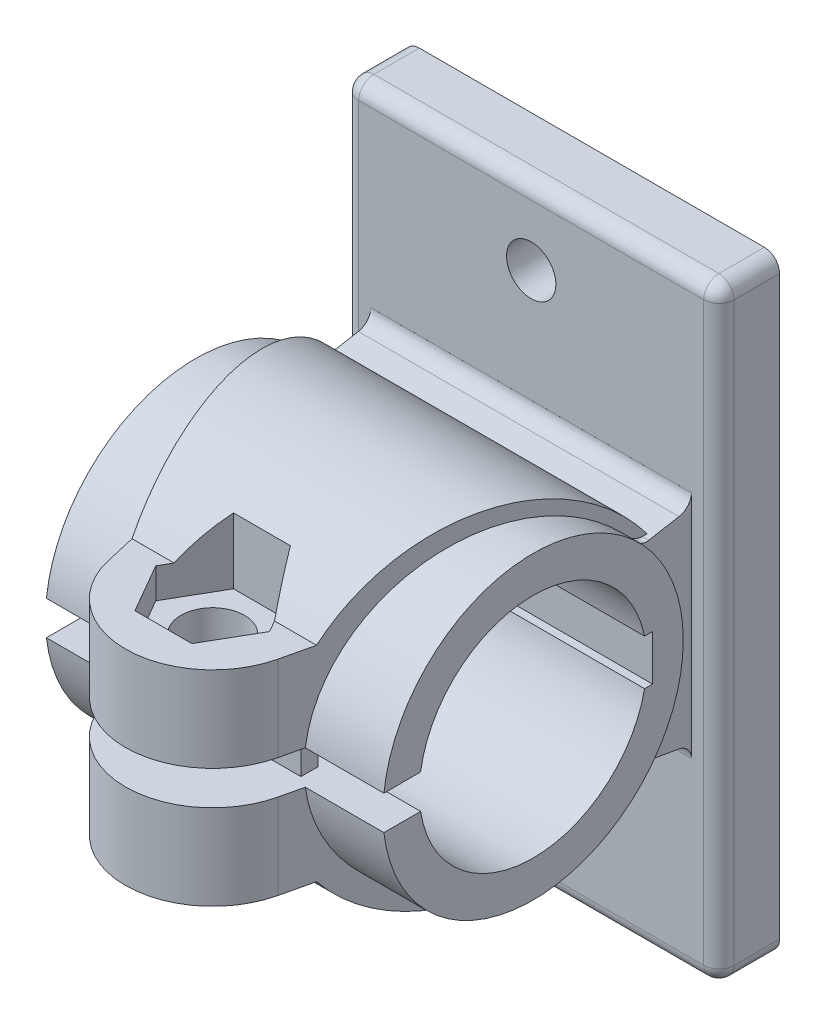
ISO-10303-21;
HEADER;
FILE_DESCRIPTION(('STEP AP214'),'2;1');
FILE_NAME('part.step','',(''),(''),'','','');
FILE_SCHEMA(('AUTOMOTIVE_DESIGN { 1 0 10303 214 1 1 1 1 }'));
ENDSEC;
DATA;
#1=APPLICATION_CONTEXT('core data for automotive mechanical design processes');
#2=APPLICATION_PROTOCOL_DEFINITION('international standard','automotive_design',2000,#1);
#3=PRODUCT_CONTEXT('',#1,'mechanical');
#4=PRODUCT('Part','Part','',(#3));
#5=PRODUCT_RELATED_PRODUCT_CATEGORY('part','',(#4));
#6=PRODUCT_DEFINITION_FORMATION('','',#4);
#7=PRODUCT_DEFINITION_CONTEXT('part definition',#1,'design');
#8=PRODUCT_DEFINITION('design','',#6,#7);
#9=PRODUCT_DEFINITION_SHAPE('','',#8);
#10=(LENGTH_UNIT() NAMED_UNIT(*) SI_UNIT(.MILLI.,.METRE.));
#11=(NAMED_UNIT(*) PLANE_ANGLE_UNIT() SI_UNIT($,.RADIAN.));
#12=(NAMED_UNIT(*) SI_UNIT($,.STERADIAN.) SOLID_ANGLE_UNIT());
#13=UNCERTAINTY_MEASURE_WITH_UNIT(LENGTH_MEASURE(1.E-05),#10,'distance_accuracy_value','');
#14=(GEOMETRIC_REPRESENTATION_CONTEXT(3) GLOBAL_UNCERTAINTY_ASSIGNED_CONTEXT((#13)) GLOBAL_UNIT_ASSIGNED_CONTEXT((#10,
#11,#12)) REPRESENTATION_CONTEXT('',''));
#15=CARTESIAN_POINT('',(0.,0.,0.));
#16=DIRECTION('',(0.,0.,1.));
#17=DIRECTION('',(1.,0.,0.));
#18=AXIS2_PLACEMENT_3D('',#15,#16,#17);
#19=CARTESIAN_POINT('',(22.25,2.04320273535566E-13,0.));
#20=DIRECTION('',(-1.,0.,0.));
#21=DIRECTION('',(0.,0.149999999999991,0.988685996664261));
#22=AXIS2_PLACEMENT_3D('',#19,#20,#21);
#23=CYLINDRICAL_SURFACE('',#22,15.);
#24=CARTESIAN_POINT('',(-22.25,0.,0.));
#25=DIRECTION('',(1.,0.,0.));
#26=DIRECTION('',(0.,0.149999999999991,-0.988685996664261));
#27=AXIS2_PLACEMENT_3D('',#24,#25,#26);
#28=CIRCLE('',#27,15.);
#29=CARTESIAN_POINT('',(-22.25,2.99999999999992,-14.6969384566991));
#30=VERTEX_POINT('',#29);
#31=CARTESIAN_POINT('',(-22.25,2.24999999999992,14.830289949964));
#32=VERTEX_POINT('',#31);
#33=EDGE_CURVE('E432',#30,#32,#28,.T.);
#34=ORIENTED_EDGE('',*,*,#33,.F.);
#35=DIRECTION('',(1.,0.,0.));
#36=VECTOR('',#35,1.);
#37=CARTESIAN_POINT('',(-24.7500000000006,2.99999999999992,-14.6969384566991));
#38=LINE('',#37,#36);
#39=CARTESIAN_POINT('',(22.25,3.00000000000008,-14.6969384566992));
#40=VERTEX_POINT('',#39);
#41=EDGE_CURVE('E419',#30,#40,#38,.T.);
#42=ORIENTED_EDGE('',*,*,#41,.T.);
#43=CARTESIAN_POINT('',(22.25,2.04320273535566E-13,0.));
#44=DIRECTION('',(-1.,0.,0.));
#45=DIRECTION('',(0.,0.149999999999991,0.988685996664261));
#46=AXIS2_PLACEMENT_3D('',#43,#44,#45);
#47=CIRCLE('',#46,15.);
#48=CARTESIAN_POINT('',(22.25,2.25000000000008,14.8302899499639));
#49=VERTEX_POINT('',#48);
#50=EDGE_CURVE('E430',#40,#49,#47,.F.);
#51=ORIENTED_EDGE('',*,*,#50,.T.);
#52=DIRECTION('',(1.,0.,0.));
#53=VECTOR('',#52,1.);
#54=CARTESIAN_POINT('',(-22.25,2.24999999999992,14.830289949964));
#55=LINE('',#54,#53);
#56=EDGE_CURVE('E955',#49,#32,#55,.F.);
#57=ORIENTED_EDGE('',*,*,#56,.T.);
#58=EDGE_LOOP('',(#34,#42,#51,#57));
#59=FACE_BOUND('',#58,.T.);
#60=ADVANCED_FACE('F14',(#59),#23,.F.);
#61=CARTESIAN_POINT('',(-21.1375,15.1568806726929,-22.1894610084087));
#62=DIRECTION('',(0.,1.,0.));
#63=DIRECTION('',(0.,0.,1.));
#64=AXIS2_PLACEMENT_3D('',#61,#62,#63);
#65=PLANE('',#64);
#66=DIRECTION('',(1.,0.,0.));
#67=VECTOR('',#66,1.);
#68=CARTESIAN_POINT('',(-24.7500000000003,15.1568806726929,-21.998410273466));
#69=LINE('',#68,#67);
#70=CARTESIAN_POINT('',(21.1375,15.1568806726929,-21.998410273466));
#71=VERTEX_POINT('',#70);
#72=CARTESIAN_POINT('',(-21.1375,15.1568806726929,-21.998410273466));
#73=VERTEX_POINT('',#72);
#74=EDGE_CURVE('E833',#71,#73,#69,.F.);
#75=ORIENTED_EDGE('',*,*,#74,.F.);
#76=DIRECTION('',(0.,0.,-1.));
#77=VECTOR('',#76,1.);
#78=CARTESIAN_POINT('',(21.1375,15.1568806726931,-21.6894610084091));
#79=LINE('',#78,#77);
#80=CARTESIAN_POINT('',(21.1375,15.1568806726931,-22.));
#81=VERTEX_POINT('',#80);
#82=EDGE_CURVE('E794',#81,#71,#79,.F.);
#83=ORIENTED_EDGE('',*,*,#82,.F.);
#84=DIRECTION('',(-1.,0.,0.));
#85=VECTOR('',#84,1.);
#86=CARTESIAN_POINT('',(-21.1375,15.1568806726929,-22.));
#87=LINE('',#86,#85);
#88=CARTESIAN_POINT('',(-21.1375,15.1568806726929,-22.));
#89=VERTEX_POINT('',#88);
#90=EDGE_CURVE('E831',#81,#89,#87,.T.);
#91=ORIENTED_EDGE('',*,*,#90,.T.);
#92=DIRECTION('',(0.,0.,1.));
#93=VECTOR('',#92,1.);
#94=CARTESIAN_POINT('',(-21.1375,15.1568806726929,-22.1894610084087));
#95=LINE('',#94,#93);
#96=EDGE_CURVE('E790',#89,#73,#95,.T.);
#97=ORIENTED_EDGE('',*,*,#96,.T.);
#98=EDGE_LOOP('',(#75,#83,#91,#97));
#99=FACE_BOUND('',#98,.T.);
#100=ADVANCED_FACE('F830',(#99),#65,.T.);
#101=CARTESIAN_POINT('',(21.1375,-15.1568806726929,-22.1894610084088));
#102=DIRECTION('',(0.,-1.,0.));
#103=DIRECTION('',(0.,0.,1.));
#104=AXIS2_PLACEMENT_3D('',#101,#102,#103);
#105=PLANE('',#104);
#106=DIRECTION('',(1.,0.,0.));
#107=VECTOR('',#106,1.);
#108=CARTESIAN_POINT('',(-24.7500000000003,-15.1568806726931,-21.998410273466));
#109=LINE('',#108,#107);
#110=CARTESIAN_POINT('',(-21.1375,-15.1568806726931,-21.998410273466));
#111=VERTEX_POINT('',#110);
#112=CARTESIAN_POINT('',(21.1375,-15.1568806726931,-21.998410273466));
#113=VERTEX_POINT('',#112);
#114=EDGE_CURVE('E1834',#111,#113,#109,.T.);
#115=ORIENTED_EDGE('',*,*,#114,.F.);
#116=DIRECTION('',(0.,0.,-1.));
#117=VECTOR('',#116,1.);
#118=CARTESIAN_POINT('',(-21.1375,-15.1568806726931,-21.689461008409));
#119=LINE('',#118,#117);
#120=CARTESIAN_POINT('',(-21.1375,-15.1568806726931,-22.));
#121=VERTEX_POINT('',#120);
#122=EDGE_CURVE('E808',#111,#121,#119,.T.);
#123=ORIENTED_EDGE('',*,*,#122,.T.);
#124=DIRECTION('',(1.,0.,0.));
#125=VECTOR('',#124,1.);
#126=CARTESIAN_POINT('',(21.1375,-15.1568806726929,-22.));
#127=LINE('',#126,#125);
#128=CARTESIAN_POINT('',(21.1375,-15.1568806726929,-22.));
#129=VERTEX_POINT('',#128);
#130=EDGE_CURVE('E852',#121,#129,#127,.T.);
#131=ORIENTED_EDGE('',*,*,#130,.T.);
#132=DIRECTION('',(0.,0.,1.));
#133=VECTOR('',#132,1.);
#134=CARTESIAN_POINT('',(21.1375,-15.1568806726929,-22.1894610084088));
#135=LINE('',#134,#133);
#136=EDGE_CURVE('E449',#113,#129,#135,.F.);
#137=ORIENTED_EDGE('',*,*,#136,.F.);
#138=EDGE_LOOP('',(#115,#123,#131,#137));
#139=FACE_BOUND('',#138,.T.);
#140=ADVANCED_FACE('F1410',(#139),#105,.T.);
#141=CARTESIAN_POINT('',(21.1375,-15.1568806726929,-22.1894610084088));
#142=DIRECTION('',(1.,0.,0.));
#143=DIRECTION('',(0.,1.,0.));
#144=AXIS2_PLACEMENT_3D('',#141,#142,#143);
#145=PLANE('',#144);
#146=CARTESIAN_POINT('',(21.1375,15.2366075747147,-20.));
#147=DIRECTION('',(1.,0.,0.));
#148=DIRECTION('',(0.,0.,-1.));
#149=AXIS2_PLACEMENT_3D('',#146,#147,#148);
#150=CIRCLE('',#149,2.);
#151=CARTESIAN_POINT('',(21.1375,13.2669920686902,-20.347296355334));
#152=VERTEX_POINT('',#151);
#153=EDGE_CURVE('E824',#152,#71,#150,.T.);
#154=ORIENTED_EDGE('',*,*,#153,.F.);
#155=DIRECTION('',(0.,-0.1736481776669,0.984807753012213));
#156=VECTOR('',#155,1.);
#157=CARTESIAN_POINT('',(21.1375,13.2122632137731,-20.0369135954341));
#158=LINE('',#157,#156);
#159=CARTESIAN_POINT('',(21.1375,12.5610526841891,-16.34371515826));
#160=VERTEX_POINT('',#159);
#161=EDGE_CURVE('E806',#152,#160,#158,.T.);
#162=ORIENTED_EDGE('',*,*,#161,.T.);
#163=CARTESIAN_POINT('',(21.1375,14.1367450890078,-16.0658780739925));
#164=DIRECTION('',(-1.,0.,0.));
#165=DIRECTION('',(0.,-0.984807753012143,-0.173648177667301));
#166=AXIS2_PLACEMENT_3D('',#163,#164,#165);
#167=CIRCLE('',#166,1.59999999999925);
#168=CARTESIAN_POINT('',(21.1375,13.0797921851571,-14.8646909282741));
#169=VERTEX_POINT('',#168);
#170=EDGE_CURVE('E815',#169,#160,#167,.F.);
#171=ORIENTED_EDGE('',*,*,#170,.F.);
#172=CARTESIAN_POINT('',(21.1375,0.,0.));
#173=DIRECTION('',(-1.,0.,0.));
#174=DIRECTION('',(0.,0.,-1.));
#175=AXIS2_PLACEMENT_3D('',#172,#173,#174);
#176=CIRCLE('',#175,19.8);
#177=CARTESIAN_POINT('',(21.1375,-13.0797921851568,-14.864690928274));
#178=VERTEX_POINT('',#177);
#179=EDGE_CURVE('E1869',#178,#169,#176,.F.);
#180=ORIENTED_EDGE('',*,*,#179,.F.);
#181=CARTESIAN_POINT('',(21.1375,-14.1367450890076,-16.0658780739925));
#182=DIRECTION('',(-1.,0.,0.));
#183=DIRECTION('',(0.,0.660595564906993,0.75074196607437));
#184=AXIS2_PLACEMENT_3D('',#181,#182,#183);
#185=CIRCLE('',#184,1.59999999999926);
#186=CARTESIAN_POINT('',(21.1375,-12.5610526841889,-16.34371515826));
#187=VERTEX_POINT('',#186);
#188=EDGE_CURVE('E1857',#187,#178,#185,.F.);
#189=ORIENTED_EDGE('',*,*,#188,.F.);
#190=DIRECTION('',(0.,-0.173648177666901,-0.984807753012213));
#191=VECTOR('',#190,1.);
#192=CARTESIAN_POINT('',(21.1375,-12.5610526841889,-16.34371515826));
#193=LINE('',#192,#191);
#194=CARTESIAN_POINT('',(21.1375,-13.26699206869,-20.347296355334));
#195=VERTEX_POINT('',#194);
#196=EDGE_CURVE('E1700',#187,#195,#193,.T.);
#197=ORIENTED_EDGE('',*,*,#196,.T.);
#198=CARTESIAN_POINT('',(21.1375,-15.2366075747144,-20.));
#199=DIRECTION('',(1.,0.,0.));
#200=DIRECTION('',(0.,0.,-1.));
#201=AXIS2_PLACEMENT_3D('',#198,#199,#200);
#202=CIRCLE('',#201,2.);
#203=EDGE_CURVE('E841',#113,#195,#202,.T.);
#204=ORIENTED_EDGE('',*,*,#203,.F.);
#205=ORIENTED_EDGE('',*,*,#136,.T.);
#206=DIRECTION('',(0.,1.,0.));
#207=VECTOR('',#206,1.);
#208=CARTESIAN_POINT('',(21.1375,-15.1568806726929,-22.));
#209=LINE('',#208,#207);
#210=EDGE_CURVE('E825',#129,#81,#209,.T.);
#211=ORIENTED_EDGE('',*,*,#210,.T.);
#212=ORIENTED_EDGE('',*,*,#82,.T.);
#213=EDGE_LOOP('',(#154,#162,#171,#180,#189,#197,#204,#205,#211,#212));
#214=FACE_BOUND('',#213,.T.);
#215=ADVANCED_FACE('F823',(#214),#145,.T.);
#216=CARTESIAN_POINT('',(-21.1375,-15.1568806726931,-22.1894610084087));
#217=DIRECTION('',(-1.,0.,0.));
#218=DIRECTION('',(0.,0.,1.));
#219=AXIS2_PLACEMENT_3D('',#216,#217,#218);
#220=PLANE('',#219);
#221=CARTESIAN_POINT('',(-21.1375,15.2366075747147,-20.));
#222=DIRECTION('',(-1.,0.,0.));
#223=DIRECTION('',(0.,0.,1.));
#224=AXIS2_PLACEMENT_3D('',#221,#222,#223);
#225=CIRCLE('',#224,2.);
#226=CARTESIAN_POINT('',(-21.1375,13.2669920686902,-20.347296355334));
#227=VERTEX_POINT('',#226);
#228=EDGE_CURVE('E837',#73,#227,#225,.T.);
#229=ORIENTED_EDGE('',*,*,#228,.F.);
#230=ORIENTED_EDGE('',*,*,#96,.F.);
#231=DIRECTION('',(0.,-1.,0.));
#232=VECTOR('',#231,1.);
#233=CARTESIAN_POINT('',(-21.1375,-15.1568806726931,-22.));
#234=LINE('',#233,#232);
#235=EDGE_CURVE('E854',#89,#121,#234,.T.);
#236=ORIENTED_EDGE('',*,*,#235,.T.);
#237=ORIENTED_EDGE('',*,*,#122,.F.);
#238=CARTESIAN_POINT('',(-21.1375,-15.2366075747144,-20.));
#239=DIRECTION('',(-1.,0.,0.));
#240=DIRECTION('',(0.,0.,1.));
#241=AXIS2_PLACEMENT_3D('',#238,#239,#240);
#242=CIRCLE('',#241,2.);
#243=CARTESIAN_POINT('',(-21.1375,-13.26699206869,-20.347296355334));
#244=VERTEX_POINT('',#243);
#245=EDGE_CURVE('E1837',#244,#111,#242,.T.);
#246=ORIENTED_EDGE('',*,*,#245,.F.);
#247=DIRECTION('',(0.,0.173648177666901,0.984807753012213));
#248=VECTOR('',#247,1.);
#249=CARTESIAN_POINT('',(-21.1375,-13.2122632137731,-20.0369135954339));
#250=LINE('',#249,#248);
#251=CARTESIAN_POINT('',(-21.1375,-12.5610526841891,-16.3437151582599));
#252=VERTEX_POINT('',#251);
#253=EDGE_CURVE('E1852',#252,#244,#250,.F.);
#254=ORIENTED_EDGE('',*,*,#253,.F.);
#255=CARTESIAN_POINT('',(-21.1375,-14.1367450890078,-16.0658780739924));
#256=DIRECTION('',(1.,0.,0.));
#257=DIRECTION('',(0.,0.984807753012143,-0.173648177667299));
#258=AXIS2_PLACEMENT_3D('',#255,#256,#257);
#259=CIRCLE('',#258,1.59999999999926);
#260=CARTESIAN_POINT('',(-21.1375,-13.0797921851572,-14.8646909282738));
#261=VERTEX_POINT('',#260);
#262=EDGE_CURVE('E1688',#252,#261,#259,.T.);
#263=ORIENTED_EDGE('',*,*,#262,.T.);
#264=CARTESIAN_POINT('',(-21.1375,0.,0.));
#265=DIRECTION('',(1.,0.,0.));
#266=DIRECTION('',(0.,0.,-1.));
#267=AXIS2_PLACEMENT_3D('',#264,#265,#266);
#268=CIRCLE('',#267,19.8);
#269=CARTESIAN_POINT('',(-21.1375,13.0797921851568,-14.8646909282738));
#270=VERTEX_POINT('',#269);
#271=EDGE_CURVE('E1684',#261,#270,#268,.T.);
#272=ORIENTED_EDGE('',*,*,#271,.T.);
#273=CARTESIAN_POINT('',(-21.1375,14.1367450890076,-16.0658780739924));
#274=DIRECTION('',(1.,0.,0.));
#275=DIRECTION('',(0.,-0.660595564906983,0.750741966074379));
#276=AXIS2_PLACEMENT_3D('',#273,#274,#275);
#277=CIRCLE('',#276,1.59999999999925);
#278=CARTESIAN_POINT('',(-21.1375,12.5610526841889,-16.3437151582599));
#279=VERTEX_POINT('',#278);
#280=EDGE_CURVE('E1679',#270,#279,#277,.T.);
#281=ORIENTED_EDGE('',*,*,#280,.T.);
#282=DIRECTION('',(0.,0.173648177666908,-0.984807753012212));
#283=VECTOR('',#282,1.);
#284=CARTESIAN_POINT('',(-21.1375,12.5610526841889,-16.3437151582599));
#285=LINE('',#284,#283);
#286=EDGE_CURVE('E1677',#227,#279,#285,.F.);
#287=ORIENTED_EDGE('',*,*,#286,.F.);
#288=EDGE_LOOP('',(#229,#230,#236,#237,#246,#254,#263,#272,#281,#287));
#289=FACE_BOUND('',#288,.T.);
#290=ADVANCED_FACE('F1465',(#289),#220,.T.);
#291=CARTESIAN_POINT('',(-22.25,-2.25000000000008,14.830289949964));
#292=DIRECTION('',(0.,1.,0.));
#293=DIRECTION('',(0.,0.,1.));
#294=AXIS2_PLACEMENT_3D('',#291,#292,#293);
#295=PLANE('',#294);
#296=DIRECTION('',(0.,0.,-1.));
#297=VECTOR('',#296,1.);
#298=CARTESIAN_POINT('',(22.25,-2.24999999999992,19.6717436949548));
#299=LINE('',#298,#297);
#300=CARTESIAN_POINT('',(22.25,-2.24999999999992,14.8302899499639));
#301=VERTEX_POINT('',#300);
#302=CARTESIAN_POINT('',(22.25,-2.24999999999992,19.6717436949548));
#303=VERTEX_POINT('',#302);
#304=EDGE_CURVE('E851',#301,#303,#299,.F.);
#305=ORIENTED_EDGE('',*,*,#304,.F.);
#306=DIRECTION('',(-1.,0.,0.));
#307=VECTOR('',#306,1.);
#308=CARTESIAN_POINT('',(22.25,-2.24999999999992,14.8302899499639));
#309=LINE('',#308,#307);
#310=CARTESIAN_POINT('',(-22.25,-2.25000000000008,14.830289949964));
#311=VERTEX_POINT('',#310);
#312=EDGE_CURVE('E858',#301,#311,#309,.T.);
#313=ORIENTED_EDGE('',*,*,#312,.T.);
#314=DIRECTION('',(0.,0.,1.));
#315=VECTOR('',#314,1.);
#316=CARTESIAN_POINT('',(-22.25,-2.25000000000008,14.830289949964));
#317=LINE('',#316,#315);
#318=CARTESIAN_POINT('',(-22.25,-2.25000000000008,19.6717436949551));
#319=VERTEX_POINT('',#318);
#320=EDGE_CURVE('E863',#311,#319,#317,.T.);
#321=ORIENTED_EDGE('',*,*,#320,.T.);
#322=DIRECTION('',(1.,0.,-1.80480815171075E-11));
#323=VECTOR('',#322,1.);
#324=CARTESIAN_POINT('',(-22.25,-2.25000000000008,19.6717436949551));
#325=LINE('',#324,#323);
#326=CARTESIAN_POINT('',(-11.8851727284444,-2.25000000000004,19.671743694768));
#327=VERTEX_POINT('',#326);
#328=EDGE_CURVE('E868',#327,#319,#325,.F.);
#329=ORIENTED_EDGE('',*,*,#328,.F.);
#330=DIRECTION('',(0.227126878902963,0.,0.973865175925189));
#331=VECTOR('',#330,1.);
#332=CARTESIAN_POINT('',(-11.8851727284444,-2.25000000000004,19.671743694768));
#333=LINE('',#332,#331);
#334=CARTESIAN_POINT('',(-11.1994495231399,-2.25000000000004,22.611959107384));
#335=VERTEX_POINT('',#334);
#336=EDGE_CURVE('E873',#335,#327,#333,.F.);
#337=ORIENTED_EDGE('',*,*,#336,.F.);
#338=CARTESIAN_POINT('',(0.,-2.25,19.9999999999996));
#339=DIRECTION('',(0.,1.,0.));
#340=DIRECTION('',(-0.973865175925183,0.,0.227126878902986));
#341=AXIS2_PLACEMENT_3D('',#338,#339,#340);
#342=CIRCLE('',#341,11.5000000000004);
#343=CARTESIAN_POINT('',(11.1994495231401,-2.24999999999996,22.6119591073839));
#344=VERTEX_POINT('',#343);
#345=EDGE_CURVE('E878',#344,#335,#342,.F.);
#346=ORIENTED_EDGE('',*,*,#345,.F.);
#347=DIRECTION('',(0.227126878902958,0.,-0.97386517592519));
#348=VECTOR('',#347,1.);
#349=CARTESIAN_POINT('',(11.1994495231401,-2.24999999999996,22.6119591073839));
#350=LINE('',#349,#348);
#351=CARTESIAN_POINT('',(11.8851727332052,-2.24999999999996,19.6717436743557));
#352=VERTEX_POINT('',#351);
#353=EDGE_CURVE('E882',#352,#344,#350,.F.);
#354=ORIENTED_EDGE('',*,*,#353,.F.);
#355=DIRECTION('',(1.,0.,1.98741046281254E-09));
#356=VECTOR('',#355,1.);
#357=CARTESIAN_POINT('',(11.8851727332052,-2.24999999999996,19.6717436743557));
#358=LINE('',#357,#356);
#359=EDGE_CURVE('E887',#303,#352,#358,.F.);
#360=ORIENTED_EDGE('',*,*,#359,.F.);
#361=EDGE_LOOP('',(#305,#313,#321,#329,#337,#346,#354,#360));
#362=FACE_BOUND('',#361,.T.);
#363=CARTESIAN_POINT('',(0.,-2.25,20.));
#364=DIRECTION('',(0.,-1.,0.));
#365=DIRECTION('',(-1.,0.,-1.4205388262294E-07));
#366=AXIS2_PLACEMENT_3D('',#363,#364,#365);
#367=CIRCLE('',#366,4.2);
#368=CARTESIAN_POINT('',(-4.19999999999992,-2.25000000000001,19.9999994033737));
#369=VERTEX_POINT('',#368);
#370=EDGE_CURVE('E891',#369,#369,#367,.F.);
#371=ORIENTED_EDGE('',*,*,#370,.F.);
#372=EDGE_LOOP('',(#371));
#373=FACE_BOUND('',#372,.T.);
#374=DIRECTION('',(1.,0.,0.));
#375=VECTOR('',#374,1.);
#376=CARTESIAN_POINT('',(-10.3846153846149,-2.25000000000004,16.5));
#377=LINE('',#376,#375);
#378=CARTESIAN_POINT('',(-4.82211538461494,-2.25,16.5));
#379=VERTEX_POINT('',#378);
#380=CARTESIAN_POINT('',(-10.3846153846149,-2.25000000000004,16.5));
#381=VERTEX_POINT('',#380);
#382=EDGE_CURVE('E896',#379,#381,#377,.F.);
#383=ORIENTED_EDGE('',*,*,#382,.F.);
#384=DIRECTION('',(0.,0.,1.));
#385=VECTOR('',#384,1.);
#386=CARTESIAN_POINT('',(-4.82211538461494,-2.25,16.5));
#387=LINE('',#386,#385);
#388=CARTESIAN_POINT('',(-4.82211538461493,-2.25,18.75));
#389=VERTEX_POINT('',#388);
#390=EDGE_CURVE('E899',#389,#379,#387,.F.);
#391=ORIENTED_EDGE('',*,*,#390,.F.);
#392=DIRECTION('',(-1.,0.,0.));
#393=VECTOR('',#392,1.);
#394=CARTESIAN_POINT('',(-4.82211538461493,-2.25,18.75));
#395=LINE('',#394,#393);
#396=CARTESIAN_POINT('',(-10.3846153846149,-2.25000000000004,18.75));
#397=VERTEX_POINT('',#396);
#398=EDGE_CURVE('E903',#389,#397,#395,.T.);
#399=ORIENTED_EDGE('',*,*,#398,.T.);
#400=DIRECTION('',(0.,0.,-1.));
#401=VECTOR('',#400,1.);
#402=CARTESIAN_POINT('',(-10.3846153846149,-2.25000000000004,18.75));
#403=LINE('',#402,#401);
#404=EDGE_CURVE('E908',#397,#381,#403,.T.);
#405=ORIENTED_EDGE('',*,*,#404,.T.);
#406=EDGE_LOOP('',(#383,#391,#399,#405));
#407=FACE_BOUND('',#406,.T.);
#408=DIRECTION('',(0.,0.,-1.));
#409=VECTOR('',#408,1.);
#410=CARTESIAN_POINT('',(4.82211538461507,-2.25,18.75));
#411=LINE('',#410,#409);
#412=CARTESIAN_POINT('',(4.82211538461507,-2.25,18.75));
#413=VERTEX_POINT('',#412);
#414=CARTESIAN_POINT('',(4.82211538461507,-2.25,16.5));
#415=VERTEX_POINT('',#414);
#416=EDGE_CURVE('E913',#413,#415,#411,.T.);
#417=ORIENTED_EDGE('',*,*,#416,.T.);
#418=DIRECTION('',(1.,0.,0.));
#419=VECTOR('',#418,1.);
#420=CARTESIAN_POINT('',(4.82211538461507,-2.25,16.5));
#421=LINE('',#420,#419);
#422=CARTESIAN_POINT('',(10.3846153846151,-2.24999999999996,16.5));
#423=VERTEX_POINT('',#422);
#424=EDGE_CURVE('E918',#415,#423,#421,.T.);
#425=ORIENTED_EDGE('',*,*,#424,.T.);
#426=DIRECTION('',(0.,0.,1.));
#427=VECTOR('',#426,1.);
#428=CARTESIAN_POINT('',(10.3846153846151,-2.24999999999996,16.5));
#429=LINE('',#428,#427);
#430=CARTESIAN_POINT('',(10.3846153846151,-2.24999999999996,18.75));
#431=VERTEX_POINT('',#430);
#432=EDGE_CURVE('E923',#431,#423,#429,.F.);
#433=ORIENTED_EDGE('',*,*,#432,.F.);
#434=DIRECTION('',(-1.,0.,0.));
#435=VECTOR('',#434,1.);
#436=CARTESIAN_POINT('',(10.3846153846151,-2.24999999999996,18.75));
#437=LINE('',#436,#435);
#438=EDGE_CURVE('E927',#413,#431,#437,.F.);
#439=ORIENTED_EDGE('',*,*,#438,.F.);
#440=EDGE_LOOP('',(#417,#425,#433,#439));
#441=FACE_BOUND('',#440,.T.);
#442=ADVANCED_FACE('F1428',(#362,#373,#407,#441),#295,.T.);
#443=CARTESIAN_POINT('',(22.25,2.25000000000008,14.8302899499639));
#444=DIRECTION('',(0.,-1.,0.));
#445=DIRECTION('',(0.,0.,1.));
#446=AXIS2_PLACEMENT_3D('',#443,#444,#445);
#447=PLANE('',#446);
#448=DIRECTION('',(-0.227126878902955,0.,0.973865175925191));
#449=VECTOR('',#448,1.);
#450=CARTESIAN_POINT('',(11.8851727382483,2.25000000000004,19.6717436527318));
#451=LINE('',#450,#449);
#452=CARTESIAN_POINT('',(11.1994495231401,2.25000000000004,22.6119591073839));
#453=VERTEX_POINT('',#452);
#454=CARTESIAN_POINT('',(11.8851727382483,2.25000000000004,19.6717436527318));
#455=VERTEX_POINT('',#454);
#456=EDGE_CURVE('E932',#453,#455,#451,.F.);
#457=ORIENTED_EDGE('',*,*,#456,.F.);
#458=CARTESIAN_POINT('',(0.,2.25,19.9999999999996));
#459=DIRECTION('',(0.,-1.,0.));
#460=DIRECTION('',(0.973865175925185,0.,0.22712687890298));
#461=AXIS2_PLACEMENT_3D('',#458,#459,#460);
#462=CIRCLE('',#461,11.5000000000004);
#463=CARTESIAN_POINT('',(-11.1994495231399,2.24999999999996,22.611959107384));
#464=VERTEX_POINT('',#463);
#465=EDGE_CURVE('E936',#464,#453,#462,.F.);
#466=ORIENTED_EDGE('',*,*,#465,.F.);
#467=DIRECTION('',(-0.227126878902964,0.,-0.973865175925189));
#468=VECTOR('',#467,1.);
#469=CARTESIAN_POINT('',(-11.1994495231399,2.24999999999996,22.611959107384));
#470=LINE('',#469,#468);
#471=CARTESIAN_POINT('',(-11.8851727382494,2.24999999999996,19.6717436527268));
#472=VERTEX_POINT('',#471);
#473=EDGE_CURVE('E940',#472,#464,#470,.F.);
#474=ORIENTED_EDGE('',*,*,#473,.F.);
#475=DIRECTION('',(-1.,0.,4.07419318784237E-09));
#476=VECTOR('',#475,1.);
#477=CARTESIAN_POINT('',(-11.8851727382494,2.24999999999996,19.6717436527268));
#478=LINE('',#477,#476);
#479=CARTESIAN_POINT('',(-22.25,2.24999999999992,19.6717436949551));
#480=VERTEX_POINT('',#479);
#481=EDGE_CURVE('E945',#480,#472,#478,.F.);
#482=ORIENTED_EDGE('',*,*,#481,.F.);
#483=DIRECTION('',(0.,0.,-1.));
#484=VECTOR('',#483,1.);
#485=CARTESIAN_POINT('',(-22.25,2.24999999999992,19.6717436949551));
#486=LINE('',#485,#484);
#487=EDGE_CURVE('E950',#480,#32,#486,.T.);
#488=ORIENTED_EDGE('',*,*,#487,.T.);
#489=ORIENTED_EDGE('',*,*,#56,.F.);
#490=DIRECTION('',(0.,0.,1.));
#491=VECTOR('',#490,1.);
#492=CARTESIAN_POINT('',(22.25,2.25000000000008,14.8302899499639));
#493=LINE('',#492,#491);
#494=CARTESIAN_POINT('',(22.25,2.25000000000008,19.6717436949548));
#495=VERTEX_POINT('',#494);
#496=EDGE_CURVE('E438',#495,#49,#493,.F.);
#497=ORIENTED_EDGE('',*,*,#496,.F.);
#498=DIRECTION('',(-1.,0.,-4.07368233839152E-09));
#499=VECTOR('',#498,1.);
#500=CARTESIAN_POINT('',(22.25,2.25000000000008,19.6717436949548));
#501=LINE('',#500,#499);
#502=EDGE_CURVE('E962',#455,#495,#501,.F.);
#503=ORIENTED_EDGE('',*,*,#502,.F.);
#504=EDGE_LOOP('',(#457,#466,#474,#482,#488,#489,#497,#503));
#505=FACE_BOUND('',#504,.T.);
#506=CARTESIAN_POINT('',(0.,2.25,20.));
#507=DIRECTION('',(0.,1.,0.));
#508=DIRECTION('',(1.,0.,-1.42053906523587E-07));
#509=AXIS2_PLACEMENT_3D('',#506,#507,#508);
#510=CIRCLE('',#509,4.2);
#511=CARTESIAN_POINT('',(4.20000000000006,2.25000000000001,19.9999994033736));
#512=VERTEX_POINT('',#511);
#513=EDGE_CURVE('E967',#512,#512,#510,.F.);
#514=ORIENTED_EDGE('',*,*,#513,.F.);
#515=EDGE_LOOP('',(#514));
#516=FACE_BOUND('',#515,.T.);
#517=DIRECTION('',(1.,0.,0.));
#518=VECTOR('',#517,1.);
#519=CARTESIAN_POINT('',(-10.3846153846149,2.24999999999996,18.75));
#520=LINE('',#519,#518);
#521=CARTESIAN_POINT('',(-4.82211538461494,2.25,18.75));
#522=VERTEX_POINT('',#521);
#523=CARTESIAN_POINT('',(-10.3846153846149,2.24999999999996,18.75));
#524=VERTEX_POINT('',#523);
#525=EDGE_CURVE('E972',#522,#524,#520,.F.);
#526=ORIENTED_EDGE('',*,*,#525,.F.);
#527=DIRECTION('',(0.,0.,-1.));
#528=VECTOR('',#527,1.);
#529=CARTESIAN_POINT('',(-4.82211538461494,2.25,18.75));
#530=LINE('',#529,#528);
#531=CARTESIAN_POINT('',(-4.82211538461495,2.25,16.5));
#532=VERTEX_POINT('',#531);
#533=EDGE_CURVE('E975',#532,#522,#530,.F.);
#534=ORIENTED_EDGE('',*,*,#533,.F.);
#535=DIRECTION('',(-1.,0.,0.));
#536=VECTOR('',#535,1.);
#537=CARTESIAN_POINT('',(-4.82211538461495,2.25,16.5));
#538=LINE('',#537,#536);
#539=CARTESIAN_POINT('',(-10.3846153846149,2.24999999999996,16.5));
#540=VERTEX_POINT('',#539);
#541=EDGE_CURVE('E979',#532,#540,#538,.T.);
#542=ORIENTED_EDGE('',*,*,#541,.T.);
#543=DIRECTION('',(0.,0.,1.));
#544=VECTOR('',#543,1.);
#545=CARTESIAN_POINT('',(-10.3846153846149,2.24999999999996,16.5));
#546=LINE('',#545,#544);
#547=EDGE_CURVE('E984',#540,#524,#546,.T.);
#548=ORIENTED_EDGE('',*,*,#547,.T.);
#549=EDGE_LOOP('',(#526,#534,#542,#548));
#550=FACE_BOUND('',#549,.T.);
#551=DIRECTION('',(0.,0.,1.));
#552=VECTOR('',#551,1.);
#553=CARTESIAN_POINT('',(4.82211538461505,2.25,16.5));
#554=LINE('',#553,#552);
#555=CARTESIAN_POINT('',(4.82211538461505,2.25,16.5));
#556=VERTEX_POINT('',#555);
#557=CARTESIAN_POINT('',(4.82211538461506,2.25,18.75));
#558=VERTEX_POINT('',#557);
#559=EDGE_CURVE('E989',#556,#558,#554,.T.);
#560=ORIENTED_EDGE('',*,*,#559,.T.);
#561=DIRECTION('',(1.,0.,0.));
#562=VECTOR('',#561,1.);
#563=CARTESIAN_POINT('',(4.82211538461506,2.25,18.75));
#564=LINE('',#563,#562);
#565=CARTESIAN_POINT('',(10.3846153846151,2.25000000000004,18.75));
#566=VERTEX_POINT('',#565);
#567=EDGE_CURVE('E994',#558,#566,#564,.T.);
#568=ORIENTED_EDGE('',*,*,#567,.T.);
#569=DIRECTION('',(0.,0.,-1.));
#570=VECTOR('',#569,1.);
#571=CARTESIAN_POINT('',(10.3846153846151,2.25000000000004,18.75));
#572=LINE('',#571,#570);
#573=CARTESIAN_POINT('',(10.384615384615,2.25000000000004,16.5));
#574=VERTEX_POINT('',#573);
#575=EDGE_CURVE('E999',#574,#566,#572,.F.);
#576=ORIENTED_EDGE('',*,*,#575,.F.);
#577=DIRECTION('',(-1.,0.,0.));
#578=VECTOR('',#577,1.);
#579=CARTESIAN_POINT('',(10.384615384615,2.25000000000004,16.5));
#580=LINE('',#579,#578);
#581=EDGE_CURVE('E1003',#556,#574,#580,.F.);
#582=ORIENTED_EDGE('',*,*,#581,.F.);
#583=EDGE_LOOP('',(#560,#568,#576,#582));
#584=FACE_BOUND('',#583,.T.);
#585=ADVANCED_FACE('F1032',(#505,#516,#550,#584),#447,.T.);
#586=CARTESIAN_POINT('',(22.25,0.,1.09999999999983));
#587=DIRECTION('',(-1.,0.,0.));
#588=DIRECTION('',(0.,-0.575365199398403,-0.817896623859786));
#589=AXIS2_PLACEMENT_3D('',#586,#587,#588);
#590=CYLINDRICAL_SURFACE('',#589,22.);
#591=CARTESIAN_POINT('',(3.7527767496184,-18.1725067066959,13.499999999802));
#592=CARTESIAN_POINT('',(4.83010719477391,-16.8992487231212,15.3659910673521));
#593=CARTESIAN_POINT('',(5.79729209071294,-15.3397104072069,17.0412044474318));
#594=CARTESIAN_POINT('',(6.62275766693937,-13.5000000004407,18.4709527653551));
#595=B_SPLINE_CURVE_WITH_KNOTS('',3,(#591,#592,#593,#594),.UNSPECIFIED.,.F.,.F.,(4,4),(0.,1.),.UNSPECIFIED.);
#596=CARTESIAN_POINT('',(3.75277674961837,-18.1725067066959,13.499999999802));
#597=VERTEX_POINT('',#596);
#598=CARTESIAN_POINT('',(6.62275766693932,-13.5000000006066,18.4709527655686));
#599=VERTEX_POINT('',#598);
#600=EDGE_CURVE('E689',#597,#599,#595,.T.);
#601=ORIENTED_EDGE('',*,*,#600,.F.);
#602=DIRECTION('',(-1.,1.81809903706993E-11,2.66527959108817E-11));
#603=VECTOR('',#602,1.);
#604=CARTESIAN_POINT('',(3.75277674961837,-18.1725067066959,13.499999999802));
#605=LINE('',#604,#603);
#606=CARTESIAN_POINT('',(-3.75277674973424,-18.1725067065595,13.500000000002));
#607=VERTEX_POINT('',#606);
#608=EDGE_CURVE('E1019',#607,#597,#605,.F.);
#609=ORIENTED_EDGE('',*,*,#608,.F.);
#610=CARTESIAN_POINT('',(-6.62275766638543,-13.5000000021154,18.4709527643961));
#611=CARTESIAN_POINT('',(-5.79729209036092,-15.3397104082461,17.0412044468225));
#612=CARTESIAN_POINT('',(-4.83010719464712,-16.8992487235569,15.3659910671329));
#613=CARTESIAN_POINT('',(-3.75277674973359,-18.1725067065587,13.5000000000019));
#614=B_SPLINE_CURVE_WITH_KNOTS('',3,(#610,#611,#612,#613),.UNSPECIFIED.,.F.,.F.,(4,4),(0.,1.),.UNSPECIFIED.);
#615=CARTESIAN_POINT('',(-6.62275766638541,-13.5000000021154,18.4709527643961));
#616=VERTEX_POINT('',#615);
#617=EDGE_CURVE('E1716',#616,#607,#614,.T.);
#618=ORIENTED_EDGE('',*,*,#617,.F.);
#619=DIRECTION('',(-1.,-9.38621781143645E-08,-7.29458742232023E-08));
#620=VECTOR('',#619,1.);
#621=CARTESIAN_POINT('',(-6.62275766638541,-13.5000000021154,18.4709527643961));
#622=LINE('',#621,#620);
#623=CARTESIAN_POINT('',(-12.1652238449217,-13.5000005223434,18.4709523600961));
#624=VERTEX_POINT('',#623);
#625=EDGE_CURVE('E1714',#616,#624,#622,.T.);
#626=ORIENTED_EDGE('',*,*,#625,.T.);
#627=CARTESIAN_POINT('',(-20.4130481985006,-12.6580343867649,-16.8937257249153));
#628=CARTESIAN_POINT('',(-20.0586345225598,-14.8182423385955,-15.3740855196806));
#629=CARTESIAN_POINT('',(-19.6169450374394,-16.6842005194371,-13.4802277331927));
#630=CARTESIAN_POINT('',(-18.5433614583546,-19.8265654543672,-8.87696075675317));
#631=CARTESIAN_POINT('',(-17.9057693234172,-20.9802205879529,-6.1431197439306));
#632=CARTESIAN_POINT('',(-16.5557260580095,-22.1515875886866,-0.354460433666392));
#633=CARTESIAN_POINT('',(-15.8639576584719,-22.1400099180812,2.61167531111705));
#634=CARTESIAN_POINT('',(-14.533795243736,-20.9858922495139,8.31509033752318));
#635=CARTESIAN_POINT('',(-13.8954012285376,-19.8433522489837,11.0523696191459));
#636=CARTESIAN_POINT('',(-12.8839683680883,-16.8829012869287,15.3891493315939));
#637=CARTESIAN_POINT('',(-12.4932594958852,-15.3098443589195,17.06441456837));
#638=CARTESIAN_POINT('',(-12.1652238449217,-13.5000003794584,18.4709521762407));
#639=B_SPLINE_CURVE_WITH_KNOTS('',3,(#627,#628,#629,#630,#631,#632,#633,#634,#635,#636,#637,
#638),.UNSPECIFIED.,.F.,.F.,(4,2,2,2,2,4),(0.,0.19108079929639,0.404105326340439,
0.619288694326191,0.834472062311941,1.),.UNSPECIFIED.);
#640=CARTESIAN_POINT('',(-20.4130481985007,-12.6580343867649,-16.8937257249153));
#641=VERTEX_POINT('',#640);
#642=EDGE_CURVE('E1059',#641,#624,#639,.T.);
#643=ORIENTED_EDGE('',*,*,#642,.F.);
#644=DIRECTION('',(1.,-6.82422265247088E-09,4.80063048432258E-09));
#645=VECTOR('',#644,1.);
#646=CARTESIAN_POINT('',(-20.4130481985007,-12.6580343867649,-16.8937257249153));
#647=LINE('',#646,#645);
#648=CARTESIAN_POINT('',(20.4130481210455,-12.6580346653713,-16.8937255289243));
#649=VERTEX_POINT('',#648);
#650=EDGE_CURVE('E1051',#649,#641,#647,.F.);
#651=ORIENTED_EDGE('',*,*,#650,.F.);
#652=CARTESIAN_POINT('',(12.165223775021,-13.5000003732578,18.4709524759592));
#653=CARTESIAN_POINT('',(12.4932594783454,-15.3098446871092,17.0644146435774));
#654=CARTESIAN_POINT('',(12.8839684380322,-16.882901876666,15.3891490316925));
#655=CARTESIAN_POINT('',(13.9264880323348,-19.934342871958,10.9190769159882));
#656=CARTESIAN_POINT('',(14.6100502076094,-21.1284915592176,7.98812747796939));
#657=CARTESIAN_POINT('',(15.9923405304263,-22.1666196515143,2.06120057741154));
#658=CARTESIAN_POINT('',(16.6610808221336,-22.0979686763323,-0.806196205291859));
#659=CARTESIAN_POINT('',(17.9440114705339,-20.9062227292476,-6.30709283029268));
#660=CARTESIAN_POINT('',(18.5582018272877,-19.7831277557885,-8.94059267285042));
#661=CARTESIAN_POINT('',(19.6169451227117,-16.6841997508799,-13.4802280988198));
#662=CARTESIAN_POINT('',(20.0586345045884,-14.8182419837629,-15.374085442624));
#663=CARTESIAN_POINT('',(20.4130481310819,-12.6580346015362,-16.8937254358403));
#664=B_SPLINE_CURVE_WITH_KNOTS('',3,(#652,#653,#654,#655,#656,#657,#658,#659,#660,#661,#662,
#663),.UNSPECIFIED.,.F.,.F.,(4,2,2,2,2,4),(0.,0.165798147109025,0.39305307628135,
0.600830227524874,0.808607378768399,1.),.UNSPECIFIED.);
#665=CARTESIAN_POINT('',(12.165223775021,-13.5000003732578,18.4709524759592));
#666=VERTEX_POINT('',#665);
#667=EDGE_CURVE('E1058',#666,#649,#664,.T.);
#668=ORIENTED_EDGE('',*,*,#667,.F.);
#669=DIRECTION('',(-1.,6.72356329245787E-08,5.22528140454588E-08));
#670=VECTOR('',#669,1.);
#671=CARTESIAN_POINT('',(12.165223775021,-13.5000003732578,18.4709524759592));
#672=LINE('',#671,#670);
#673=EDGE_CURVE('E1065',#666,#599,#672,.T.);
#674=ORIENTED_EDGE('',*,*,#673,.T.);
#675=EDGE_LOOP('',(#601,#609,#618,#626,#643,#651,#668,#674));
#676=FACE_BOUND('',#675,.T.);
#677=ADVANCED_FACE('F1021',(#676),#590,.T.);
#678=CARTESIAN_POINT('',(12.165223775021,-13.5,18.4709521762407));
#679=DIRECTION('',(0.,-1.,0.));
#680=DIRECTION('',(0.,0.,1.));
#681=AXIS2_PLACEMENT_3D('',#678,#679,#680);
#682=PLANE('',#681);
#683=DIRECTION('',(-0.500000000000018,0.,-0.866025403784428));
#684=VECTOR('',#683,1.);
#685=CARTESIAN_POINT('',(7.50555349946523,-13.5,20.));
#686=LINE('',#685,#684);
#687=CARTESIAN_POINT('',(7.50555349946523,-13.5,20.));
#688=VERTEX_POINT('',#687);
#689=EDGE_CURVE('E1074',#599,#688,#686,.F.);
#690=ORIENTED_EDGE('',*,*,#689,.F.);
#691=ORIENTED_EDGE('',*,*,#673,.F.);
#692=DIRECTION('',(-0.227126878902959,0.,0.97386517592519));
#693=VECTOR('',#692,1.);
#694=CARTESIAN_POINT('',(12.165223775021,-13.5,18.4709524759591));
#695=LINE('',#694,#693);
#696=CARTESIAN_POINT('',(11.1994495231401,-13.5,22.6119591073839));
#697=VERTEX_POINT('',#696);
#698=EDGE_CURVE('E1072',#697,#666,#695,.F.);
#699=ORIENTED_EDGE('',*,*,#698,.F.);
#700=CARTESIAN_POINT('',(1.16964624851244E-13,-13.5,19.9999999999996));
#701=DIRECTION('',(0.,-1.,0.));
#702=DIRECTION('',(0.973865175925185,0.,0.22712687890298));
#703=AXIS2_PLACEMENT_3D('',#700,#701,#702);
#704=CIRCLE('',#703,11.5000000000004);
#705=CARTESIAN_POINT('',(-11.1994495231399,-13.5,22.611959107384));
#706=VERTEX_POINT('',#705);
#707=EDGE_CURVE('E1082',#706,#697,#704,.F.);
#708=ORIENTED_EDGE('',*,*,#707,.F.);
#709=DIRECTION('',(-0.227126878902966,0.,-0.973865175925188));
#710=VECTOR('',#709,1.);
#711=CARTESIAN_POINT('',(-11.1994495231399,-13.5,22.611959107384));
#712=LINE('',#711,#710);
#713=EDGE_CURVE('E1086',#624,#706,#712,.F.);
#714=ORIENTED_EDGE('',*,*,#713,.F.);
#715=ORIENTED_EDGE('',*,*,#625,.F.);
#716=DIRECTION('',(-0.499999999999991,0.,0.866025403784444));
#717=VECTOR('',#716,1.);
#718=CARTESIAN_POINT('',(-6.6227576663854,-13.5,18.4709527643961));
#719=LINE('',#718,#717);
#720=CARTESIAN_POINT('',(-7.50555349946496,-13.5,20.));
#721=VERTEX_POINT('',#720);
#722=EDGE_CURVE('E1091',#721,#616,#719,.F.);
#723=ORIENTED_EDGE('',*,*,#722,.F.);
#724=DIRECTION('',(0.5,0.,0.866025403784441));
#725=VECTOR('',#724,1.);
#726=CARTESIAN_POINT('',(-7.50555349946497,-13.5,20.));
#727=LINE('',#726,#725);
#728=CARTESIAN_POINT('',(-3.75277674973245,-13.5,26.5));
#729=VERTEX_POINT('',#728);
#730=EDGE_CURVE('E1095',#729,#721,#727,.F.);
#731=ORIENTED_EDGE('',*,*,#730,.F.);
#732=DIRECTION('',(1.,0.,0.));
#733=VECTOR('',#732,1.);
#734=CARTESIAN_POINT('',(-3.75277674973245,-13.5,26.5));
#735=LINE('',#734,#733);
#736=CARTESIAN_POINT('',(3.75277674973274,-13.5,26.5));
#737=VERTEX_POINT('',#736);
#738=EDGE_CURVE('E1099',#737,#729,#735,.F.);
#739=ORIENTED_EDGE('',*,*,#738,.F.);
#740=DIRECTION('',(0.49999999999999,0.,-0.866025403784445));
#741=VECTOR('',#740,1.);
#742=CARTESIAN_POINT('',(3.75277674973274,-13.5,26.5));
#743=LINE('',#742,#741);
#744=EDGE_CURVE('E1103',#688,#737,#743,.F.);
#745=ORIENTED_EDGE('',*,*,#744,.F.);
#746=EDGE_LOOP('',(#690,#691,#699,#708,#714,#715,#723,#731,#739,#745));
#747=FACE_BOUND('',#746,.T.);
#748=ADVANCED_FACE('F1031',(#747),#682,.T.);
#749=CARTESIAN_POINT('',(22.25,0.,1.09999999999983));
#750=DIRECTION('',(-1.,0.,0.));
#751=DIRECTION('',(0.,0.613636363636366,0.789588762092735));
#752=AXIS2_PLACEMENT_3D('',#749,#750,#751);
#753=CYLINDRICAL_SURFACE('',#752,22.);
#754=CARTESIAN_POINT('',(6.6227576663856,13.5000000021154,18.4709527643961));
#755=CARTESIAN_POINT('',(5.81026415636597,15.310799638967,17.0636727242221));
#756=CARTESIAN_POINT('',(4.84147733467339,16.8858107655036,15.3856847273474));
#757=CARTESIAN_POINT('',(3.75277674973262,18.1725067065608,13.5));
#758=B_SPLINE_CURVE_WITH_KNOTS('',3,(#754,#755,#756,#757),.UNSPECIFIED.,.F.,.F.,(4,4),(0.,1.),.UNSPECIFIED.);
#759=CARTESIAN_POINT('',(6.62275766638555,13.5000000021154,18.4709527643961));
#760=VERTEX_POINT('',#759);
#761=CARTESIAN_POINT('',(3.75277674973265,18.1725067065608,13.5));
#762=VERTEX_POINT('',#761);
#763=EDGE_CURVE('E1108',#760,#762,#758,.T.);
#764=ORIENTED_EDGE('',*,*,#763,.F.);
#765=DIRECTION('',(1.,9.38621826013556E-08,-7.29458844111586E-08));
#766=VECTOR('',#765,1.);
#767=CARTESIAN_POINT('',(6.62275766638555,13.5000000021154,18.4709527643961));
#768=LINE('',#767,#766);
#769=CARTESIAN_POINT('',(12.1652238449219,13.5000005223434,18.470952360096));
#770=VERTEX_POINT('',#769);
#771=EDGE_CURVE('E1120',#770,#760,#768,.F.);
#772=ORIENTED_EDGE('',*,*,#771,.F.);
#773=CARTESIAN_POINT('',(20.4130479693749,12.6580357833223,-16.8937247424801));
#774=CARTESIAN_POINT('',(20.0586343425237,14.8182429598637,-15.3740847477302));
#775=CARTESIAN_POINT('',(19.6169449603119,16.6842005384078,-13.4802274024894));
#776=CARTESIAN_POINT('',(18.5433615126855,19.8265651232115,-8.87696098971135));
#777=CARTESIAN_POINT('',(17.9057693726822,20.9802202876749,-6.1431199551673));
#778=CARTESIAN_POINT('',(16.5557260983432,22.1515873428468,-0.354460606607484));
#779=CARTESIAN_POINT('',(15.8639576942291,22.1400097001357,2.61167515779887));
#780=CARTESIAN_POINT('',(14.5337952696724,20.985892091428,8.31509022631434));
#781=CARTESIAN_POINT('',(13.8954012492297,19.8433521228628,11.0523695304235));
#782=CARTESIAN_POINT('',(12.8839683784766,16.8829012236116,15.389149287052));
#783=CARTESIAN_POINT('',(12.4932595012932,15.309844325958,17.0644145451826));
#784=CARTESIAN_POINT('',(12.1652238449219,13.5000003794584,18.4709521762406));
#785=B_SPLINE_CURVE_WITH_KNOTS('',3,(#773,#774,#775,#776,#777,#778,#779,#780,#781,#782,#783,
#784),.UNSPECIFIED.,.F.,.F.,(4,2,2,2,2,4),(0.,0.191080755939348,0.40410529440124,
0.619288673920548,0.834472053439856,1.),.UNSPECIFIED.);
#786=CARTESIAN_POINT('',(20.4130479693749,12.6580357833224,-16.8937247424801));
#787=VERTEX_POINT('',#786);
#788=EDGE_CURVE('E1210',#787,#770,#785,.T.);
#789=ORIENTED_EDGE('',*,*,#788,.F.);
#790=DIRECTION('',(-1.,-2.73832469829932E-08,-1.92632706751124E-08));
#791=VECTOR('',#790,1.);
#792=CARTESIAN_POINT('',(20.4130479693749,12.6580357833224,-16.8937247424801));
#793=LINE('',#792,#791);
#794=CARTESIAN_POINT('',(-20.4130481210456,12.6580346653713,-16.8937255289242));
#795=VERTEX_POINT('',#794);
#796=EDGE_CURVE('E1218',#795,#787,#793,.F.);
#797=ORIENTED_EDGE('',*,*,#796,.F.);
#798=CARTESIAN_POINT('',(-12.1652239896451,13.5000015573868,18.4709515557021));
#799=CARTESIAN_POINT('',(-12.4932596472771,15.3098453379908,17.0644139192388));
#800=CARTESIAN_POINT('',(-12.8839685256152,16.882902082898,15.389148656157));
#801=CARTESIAN_POINT('',(-13.9264879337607,19.9343425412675,10.9190773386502));
#802=CARTESIAN_POINT('',(-14.6100500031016,21.1284911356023,7.98812835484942));
#803=CARTESIAN_POINT('',(-15.9923402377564,22.1666195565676,2.06120183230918));
#804=CARTESIAN_POINT('',(-16.6610805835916,22.0979687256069,-0.806195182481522));
#805=CARTESIAN_POINT('',(-17.9440113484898,20.9062228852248,-6.3070923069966));
#806=CARTESIAN_POINT('',(-18.5582017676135,19.7831278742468,-8.94059241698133));
#807=CARTESIAN_POINT('',(-19.6169451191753,16.6841997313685,-13.4802280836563));
#808=CARTESIAN_POINT('',(-20.0586345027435,14.8182419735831,-15.3740854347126));
#809=CARTESIAN_POINT('',(-20.413048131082,12.6580346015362,-16.8937254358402));
#810=B_SPLINE_CURVE_WITH_KNOTS('',3,(#798,#799,#800,#801,#802,#803,#804,#805,#806,#807,#808,
#809),.UNSPECIFIED.,.F.,.F.,(4,2,2,2,2,4),(0.,0.165798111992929,0.393053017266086,
0.600830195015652,0.808607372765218,1.),.UNSPECIFIED.);
#811=CARTESIAN_POINT('',(-12.1652239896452,13.5000015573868,18.4709515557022));
#812=VERTEX_POINT('',#811);
#813=EDGE_CURVE('E1157',#812,#795,#810,.T.);
#814=ORIENTED_EDGE('',*,*,#813,.F.);
#815=DIRECTION('',(0.999999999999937,-2.80924764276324E-07,2.1832335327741E-07));
#816=VECTOR('',#815,1.);
#817=CARTESIAN_POINT('',(-12.1652239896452,13.5000015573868,18.4709515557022));
#818=LINE('',#817,#816);
#819=CARTESIAN_POINT('',(-6.62275766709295,13.5000000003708,18.470952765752));
#820=VERTEX_POINT('',#819);
#821=EDGE_CURVE('E1149',#820,#812,#818,.F.);
#822=ORIENTED_EDGE('',*,*,#821,.F.);
#823=CARTESIAN_POINT('',(-3.75277674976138,18.1725067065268,13.5000000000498));
#824=CARTESIAN_POINT('',(-4.83010719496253,16.8992487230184,15.3659910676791));
#825=CARTESIAN_POINT('',(-5.79729209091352,15.339710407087,17.0412044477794));
#826=CARTESIAN_POINT('',(-6.62275766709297,13.5000000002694,18.4709527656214));
#827=B_SPLINE_CURVE_WITH_KNOTS('',3,(#823,#824,#825,#826),.UNSPECIFIED.,.F.,.F.,(4,4),(0.,1.),.UNSPECIFIED.);
#828=CARTESIAN_POINT('',(-3.75277674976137,18.1725067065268,13.5000000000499));
#829=VERTEX_POINT('',#828);
#830=EDGE_CURVE('E623',#829,#820,#827,.T.);
#831=ORIENTED_EDGE('',*,*,#830,.F.);
#832=DIRECTION('',(1.,4.52866644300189E-12,-6.63552353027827E-12));
#833=VECTOR('',#832,1.);
#834=CARTESIAN_POINT('',(-3.75277674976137,18.1725067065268,13.5000000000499));
#835=LINE('',#834,#833);
#836=EDGE_CURVE('E1161',#762,#829,#835,.F.);
#837=ORIENTED_EDGE('',*,*,#836,.F.);
#838=EDGE_LOOP('',(#764,#772,#789,#797,#814,#822,#831,#837));
#839=FACE_BOUND('',#838,.T.);
#840=ADVANCED_FACE('F1122',(#839),#753,.T.);
#841=CARTESIAN_POINT('',(-12.1652239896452,13.5,18.4709515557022));
#842=DIRECTION('',(0.,1.,0.));
#843=DIRECTION('',(0.,0.,1.));
#844=AXIS2_PLACEMENT_3D('',#841,#842,#843);
#845=PLANE('',#844);
#846=DIRECTION('',(0.5,0.,0.866025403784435));
#847=VECTOR('',#846,1.);
#848=CARTESIAN_POINT('',(6.62275766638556,13.5,18.4709527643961));
#849=LINE('',#848,#847);
#850=CARTESIAN_POINT('',(7.50555349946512,13.5,20.));
#851=VERTEX_POINT('',#850);
#852=EDGE_CURVE('E1168',#851,#760,#849,.F.);
#853=ORIENTED_EDGE('',*,*,#852,.F.);
#854=DIRECTION('',(-0.499999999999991,0.,0.866025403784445));
#855=VECTOR('',#854,1.);
#856=CARTESIAN_POINT('',(7.50555349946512,13.5,20.));
#857=LINE('',#856,#855);
#858=CARTESIAN_POINT('',(3.75277674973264,13.5,26.5));
#859=VERTEX_POINT('',#858);
#860=EDGE_CURVE('E1169',#859,#851,#857,.F.);
#861=ORIENTED_EDGE('',*,*,#860,.F.);
#862=DIRECTION('',(-1.,0.,0.));
#863=VECTOR('',#862,1.);
#864=CARTESIAN_POINT('',(3.75277674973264,13.5,26.5));
#865=LINE('',#864,#863);
#866=CARTESIAN_POINT('',(-3.75277674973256,13.5,26.5));
#867=VERTEX_POINT('',#866);
#868=EDGE_CURVE('E1178',#867,#859,#865,.F.);
#869=ORIENTED_EDGE('',*,*,#868,.F.);
#870=DIRECTION('',(-0.5,0.,-0.866025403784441));
#871=VECTOR('',#870,1.);
#872=CARTESIAN_POINT('',(-3.75277674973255,13.5,26.5));
#873=LINE('',#872,#871);
#874=CARTESIAN_POINT('',(-7.50555349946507,13.5,20.));
#875=VERTEX_POINT('',#874);
#876=EDGE_CURVE('E1182',#875,#867,#873,.F.);
#877=ORIENTED_EDGE('',*,*,#876,.F.);
#878=DIRECTION('',(0.5,0.,-0.866025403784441));
#879=VECTOR('',#878,1.);
#880=CARTESIAN_POINT('',(-7.50555349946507,13.5,20.));
#881=LINE('',#880,#879);
#882=EDGE_CURVE('E1187',#820,#875,#881,.F.);
#883=ORIENTED_EDGE('',*,*,#882,.F.);
#884=ORIENTED_EDGE('',*,*,#821,.T.);
#885=DIRECTION('',(0.227126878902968,0.,0.973865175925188));
#886=VECTOR('',#885,1.);
#887=CARTESIAN_POINT('',(-12.1652239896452,13.5,18.4709515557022));
#888=LINE('',#887,#886);
#889=CARTESIAN_POINT('',(-11.19944952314,13.5,22.611959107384));
#890=VERTEX_POINT('',#889);
#891=EDGE_CURVE('E1191',#890,#812,#888,.F.);
#892=ORIENTED_EDGE('',*,*,#891,.F.);
#893=CARTESIAN_POINT('',(0.,13.5,19.9999999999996));
#894=DIRECTION('',(0.,1.,0.));
#895=DIRECTION('',(-0.973865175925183,0.,0.227126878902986));
#896=AXIS2_PLACEMENT_3D('',#893,#894,#895);
#897=CIRCLE('',#896,11.5000000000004);
#898=CARTESIAN_POINT('',(11.19944952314,13.5,22.6119591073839));
#899=VERTEX_POINT('',#898);
#900=EDGE_CURVE('E1195',#899,#890,#897,.F.);
#901=ORIENTED_EDGE('',*,*,#900,.F.);
#902=DIRECTION('',(0.227126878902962,0.,-0.973865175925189));
#903=VECTOR('',#902,1.);
#904=CARTESIAN_POINT('',(11.19944952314,13.5,22.6119591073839));
#905=LINE('',#904,#903);
#906=EDGE_CURVE('E795',#770,#899,#905,.F.);
#907=ORIENTED_EDGE('',*,*,#906,.F.);
#908=ORIENTED_EDGE('',*,*,#771,.T.);
#909=EDGE_LOOP('',(#853,#861,#869,#877,#883,#884,#892,#901,#907,#908));
#910=FACE_BOUND('',#909,.T.);
#911=ADVANCED_FACE('F1131',(#910),#845,.T.);
#912=CARTESIAN_POINT('',(20.4130481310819,-22.1666196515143,-16.8937254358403));
#913=DIRECTION('',(0.973865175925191,0.,0.227126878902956));
#914=DIRECTION('',(0.,1.,0.));
#915=AXIS2_PLACEMENT_3D('',#912,#913,#914);
#916=PLANE('',#915);
#917=DIRECTION('',(-0.223850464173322,0.16924204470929,0.959816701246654));
#918=VECTOR('',#917,1.);
#919=CARTESIAN_POINT('',(20.4130481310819,-12.6580346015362,-16.8937254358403));
#920=LINE('',#919,#918);
#921=CARTESIAN_POINT('',(20.2847735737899,-12.5610526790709,-16.3437151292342));
#922=VERTEX_POINT('',#921);
#923=EDGE_CURVE('E1686',#922,#649,#920,.F.);
#924=ORIENTED_EDGE('',*,*,#923,.F.);
#925=CARTESIAN_POINT('',(20.2847735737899,-12.5610526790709,-16.3437151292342));
#926=CARTESIAN_POINT('',(20.2491883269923,-12.5341485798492,-16.1911341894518));
#927=CARTESIAN_POINT('',(20.2132888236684,-12.5295600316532,-16.0372057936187));
#928=CARTESIAN_POINT('',(20.1427126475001,-12.5638162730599,-15.7345922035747));
#929=CARTESIAN_POINT('',(20.1080359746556,-12.6026610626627,-15.5859070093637));
#930=CARTESIAN_POINT('',(20.0220620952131,-12.7582217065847,-15.2172717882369));
#931=CARTESIAN_POINT('',(19.976952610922,-12.8989102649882,-15.02385321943));
#932=CARTESIAN_POINT('',(19.939832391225,-13.0797924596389,-14.8646906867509));
#933=B_SPLINE_CURVE_WITH_KNOTS('',3,(#925,#926,#927,#928,#929,#930,#931,#932),.UNSPECIFIED.,.F.,
.F.,(4,2,2,4),(0.,0.278218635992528,0.556437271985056,1.),.UNSPECIFIED.);
#934=CARTESIAN_POINT('',(19.939832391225,-13.0797924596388,-14.8646906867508));
#935=VERTEX_POINT('',#934);
#936=EDGE_CURVE('E478',#922,#935,#933,.T.);
#937=ORIENTED_EDGE('',*,*,#936,.T.);
#938=CARTESIAN_POINT('',(19.939832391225,-13.0797924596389,-14.8646906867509));
#939=CARTESIAN_POINT('',(19.4843720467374,-15.2991939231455,-12.9117867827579));
#940=CARTESIAN_POINT('',(18.9166860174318,-17.0692786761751,-10.4776862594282));
#941=CARTESIAN_POINT('',(17.8305194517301,-19.0345816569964,-5.82046647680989));
#942=CARTESIAN_POINT('',(17.3754979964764,-19.5189830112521,-3.86944442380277));
#943=CARTESIAN_POINT('',(16.4616169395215,-19.8983212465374,0.0490567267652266));
#944=CARTESIAN_POINT('',(16.0027573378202,-19.7932581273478,2.01653582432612));
#945=CARTESIAN_POINT('',(14.6660391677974,-18.633452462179,7.74806034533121));
#946=CARTESIAN_POINT('',(13.828041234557,-16.7340936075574,11.3411929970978));
#947=CARTESIAN_POINT('',(12.4514506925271,-10.6732057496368,17.243680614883));
#948=CARTESIAN_POINT('',(12.0013670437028,-6.60587422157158,19.1735305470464));
#949=CARTESIAN_POINT('',(11.8851727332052,-2.25000009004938,19.6717436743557));
#950=B_SPLINE_CURVE_WITH_KNOTS('',3,(#938,#939,#940,#941,#942,#943,#944,#945,#946,#947,#948,
#949),.UNSPECIFIED.,.F.,.F.,(4,2,2,2,2,4),(0.,0.193981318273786,0.325012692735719,
0.456044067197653,0.718106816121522,1.),.UNSPECIFIED.);
#951=EDGE_CURVE('E1438',#935,#352,#950,.T.);
#952=ORIENTED_EDGE('',*,*,#951,.T.);
#953=ORIENTED_EDGE('',*,*,#353,.T.);
#954=DIRECTION('',(0.,-1.,0.));
#955=VECTOR('',#954,1.);
#956=CARTESIAN_POINT('',(11.1994495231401,-2.24999999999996,22.6119591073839));
#957=LINE('',#956,#955);
#958=EDGE_CURVE('E1445',#344,#697,#957,.T.);
#959=ORIENTED_EDGE('',*,*,#958,.T.);
#960=ORIENTED_EDGE('',*,*,#698,.T.);
#961=ORIENTED_EDGE('',*,*,#667,.T.);
#962=EDGE_LOOP('',(#924,#937,#952,#953,#959,#960,#961));
#963=FACE_BOUND('',#962,.T.);
#964=ADVANCED_FACE('F1442',(#963),#916,.T.);
#965=CARTESIAN_POINT('',(-11.1994495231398,-22.1515875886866,22.611959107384));
#966=DIRECTION('',(-0.973865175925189,0.,0.227126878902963));
#967=DIRECTION('',(0.,1.,0.));
#968=AXIS2_PLACEMENT_3D('',#965,#966,#967);
#969=PLANE('',#968);
#970=DIRECTION('',(-0.223850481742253,-0.169241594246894,-0.959816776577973));
#971=VECTOR('',#970,1.);
#972=CARTESIAN_POINT('',(-20.284773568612,-12.5610526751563,-16.3437151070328));
#973=LINE('',#972,#971);
#974=CARTESIAN_POINT('',(-20.284773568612,-12.5610526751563,-16.3437151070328));
#975=VERTEX_POINT('',#974);
#976=EDGE_CURVE('E1475',#641,#975,#973,.F.);
#977=ORIENTED_EDGE('',*,*,#976,.F.);
#978=ORIENTED_EDGE('',*,*,#642,.T.);
#979=ORIENTED_EDGE('',*,*,#713,.T.);
#980=DIRECTION('',(0.,1.,0.));
#981=VECTOR('',#980,1.);
#982=CARTESIAN_POINT('',(-11.1994495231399,-13.5,22.611959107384));
#983=LINE('',#982,#981);
#984=EDGE_CURVE('E1482',#335,#706,#983,.F.);
#985=ORIENTED_EDGE('',*,*,#984,.F.);
#986=ORIENTED_EDGE('',*,*,#336,.T.);
#987=CARTESIAN_POINT('',(-11.8851727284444,-2.2500000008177,19.671743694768));
#988=CARTESIAN_POINT('',(-12.0013669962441,-6.6058743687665,19.1735307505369));
#989=CARTESIAN_POINT('',(-12.4514506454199,-10.6732061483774,17.2436808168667));
#990=CARTESIAN_POINT('',(-13.5951052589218,-15.7085177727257,12.3399661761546));
#991=CARTESIAN_POINT('',(-14.1095111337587,-17.2141770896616,10.1343180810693));
#992=CARTESIAN_POINT('',(-15.1155967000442,-19.0345820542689,5.82046627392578));
#993=CARTESIAN_POINT('',(-15.5706181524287,-19.5189834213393,3.86944423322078));
#994=CARTESIAN_POINT('',(-16.4844992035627,-19.8983216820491,-0.0490568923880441));
#995=CARTESIAN_POINT('',(-16.9433588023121,-19.7932585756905,-2.01653597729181));
#996=CARTESIAN_POINT('',(-18.2800769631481,-18.6334529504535,-7.74806045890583));
#997=CARTESIAN_POINT('',(-19.1180748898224,-16.7340941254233,-11.3411930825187));
#998=CARTESIAN_POINT('',(-19.8355361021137,-13.5752376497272,-14.4174934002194));
#999=CARTESIAN_POINT('',(-19.8883895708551,-13.3304669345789,-14.6441163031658));
#1000=CARTESIAN_POINT('',(-19.9398324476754,-13.0797921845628,-14.8646909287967));
#1001=B_SPLINE_CURVE_WITH_KNOTS('',3,(#987,#988,#989,#990,#991,#992,#993,#994,#995,#996,#997,
#998,#999,#1000),.UNSPECIFIED.,.F.,.F.,(4,2,2,2,2,2,4),(0.,0.282606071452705,0.453054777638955,
0.584417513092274,0.715780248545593,0.978505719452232,1.),.UNSPECIFIED.);
#1002=CARTESIAN_POINT('',(-19.9398324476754,-13.0797921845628,-14.8646909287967));
#1003=VERTEX_POINT('',#1002);
#1004=EDGE_CURVE('E1498',#327,#1003,#1001,.T.);
#1005=ORIENTED_EDGE('',*,*,#1004,.T.);
#1006=CARTESIAN_POINT('',(-19.9398324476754,-13.0797921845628,-14.8646909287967));
#1007=CARTESIAN_POINT('',(-19.9769526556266,-12.8989100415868,-15.0238534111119));
#1008=CARTESIAN_POINT('',(-20.0220621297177,-12.7582215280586,-15.2172719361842));
#1009=CARTESIAN_POINT('',(-20.1080359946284,-12.6026609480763,-15.5859070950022));
#1010=CARTESIAN_POINT('',(-20.1427126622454,-12.5638161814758,-15.7345922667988));
#1011=CARTESIAN_POINT('',(-20.213288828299,-12.5295599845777,-16.037205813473));
#1012=CARTESIAN_POINT('',(-20.2491883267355,-12.5341485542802,-16.1911341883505));
#1013=CARTESIAN_POINT('',(-20.2847735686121,-12.5610526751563,-16.3437151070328));
#1014=B_SPLINE_CURVE_WITH_KNOTS('',3,(#1006,#1007,#1008,#1009,#1010,#1011,#1012,#1013),
.UNSPECIFIED.,.F.,.F.,(4,2,2,4),(0.,0.443562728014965,0.721781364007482,1.),.UNSPECIFIED.);
#1015=EDGE_CURVE('E1513',#1003,#975,#1014,.T.);
#1016=ORIENTED_EDGE('',*,*,#1015,.T.);
#1017=EDGE_LOOP('',(#977,#978,#979,#985,#986,#1005,#1016));
#1018=FACE_BOUND('',#1017,.T.);
#1019=ADVANCED_FACE('F1464',(#1018),#969,.T.);
#1020=CARTESIAN_POINT('',(22.25,0.,0.));
#1021=DIRECTION('',(-1.,0.,0.));
#1022=DIRECTION('',(0.,0.,-1.));
#1023=AXIS2_PLACEMENT_3D('',#1020,#1021,#1022);
#1024=CYLINDRICAL_SURFACE('',#1023,19.8);
#1025=ORIENTED_EDGE('',*,*,#359,.T.);
#1026=ORIENTED_EDGE('',*,*,#951,.F.);
#1027=DIRECTION('',(0.999999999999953,2.29180406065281E-07,-2.01661249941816E-07));
#1028=VECTOR('',#1027,1.);
#1029=CARTESIAN_POINT('',(19.939832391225,-13.0797924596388,-14.8646906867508));
#1030=LINE('',#1029,#1028);
#1031=EDGE_CURVE('E1525',#178,#935,#1030,.F.);
#1032=ORIENTED_EDGE('',*,*,#1031,.F.);
#1033=ORIENTED_EDGE('',*,*,#179,.T.);
#1034=DIRECTION('',(-0.999999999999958,2.18365337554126E-07,1.9214481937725E-07));
#1035=VECTOR('',#1034,1.);
#1036=CARTESIAN_POINT('',(21.1375,13.079792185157,-14.864690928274));
#1037=LINE('',#1036,#1035);
#1038=CARTESIAN_POINT('',(19.939832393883,13.0797924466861,-14.8646906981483));
#1039=VERTEX_POINT('',#1038);
#1040=EDGE_CURVE('E1879',#169,#1039,#1037,.T.);
#1041=ORIENTED_EDGE('',*,*,#1040,.T.);
#1042=CARTESIAN_POINT('',(11.8851727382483,2.25000018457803,19.6717436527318));
#1043=CARTESIAN_POINT('',(12.0013670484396,6.60587430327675,19.1735305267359));
#1044=CARTESIAN_POINT('',(12.4514506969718,10.6732058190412,17.2436805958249));
#1045=CARTESIAN_POINT('',(13.595105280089,15.7085172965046,12.3399660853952));
#1046=CARTESIAN_POINT('',(14.1095111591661,17.2141766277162,10.1343179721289));
#1047=CARTESIAN_POINT('',(15.1155967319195,19.0345816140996,5.82046613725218));
#1048=CARTESIAN_POINT('',(15.5706181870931,19.5189829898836,3.86944408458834));
#1049=CARTESIAN_POINT('',(16.4844992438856,19.8983212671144,-0.0490570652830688));
#1050=CARTESIAN_POINT('',(16.9433588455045,19.7932581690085,-2.0165361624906));
#1051=CARTESIAN_POINT('',(18.2800770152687,18.6334525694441,-7.74806068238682));
#1052=CARTESIAN_POINT('',(19.1180749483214,16.73409376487,-11.341193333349));
#1053=CARTESIAN_POINT('',(19.8355361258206,13.575237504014,-14.4174935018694));
#1054=CARTESIAN_POINT('',(19.8883895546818,13.3304669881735,-14.6441162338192));
#1055=CARTESIAN_POINT('',(19.939832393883,13.0797924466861,-14.8646906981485));
#1056=B_SPLINE_CURVE_WITH_KNOTS('',3,(#1042,#1043,#1044,#1045,#1046,#1047,#1048,#1049,#1050,
#1051,#1052,#1053,#1054,#1055),.UNSPECIFIED.,.F.,.F.,(4,2,2,2,2,2,4),(0.,0.282606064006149,
0.453054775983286,0.584417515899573,0.715780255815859,0.978505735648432,1.),.UNSPECIFIED.);
#1057=EDGE_CURVE('E1553',#455,#1039,#1056,.T.);
#1058=ORIENTED_EDGE('',*,*,#1057,.F.);
#1059=ORIENTED_EDGE('',*,*,#502,.T.);
#1060=CARTESIAN_POINT('',(22.25,0.,0.));
#1061=DIRECTION('',(-1.,0.,0.));
#1062=DIRECTION('',(0.,0.113636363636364,0.993522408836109));
#1063=AXIS2_PLACEMENT_3D('',#1060,#1061,#1062);
#1064=CIRCLE('',#1063,19.8);
#1065=EDGE_CURVE('E1440',#303,#495,#1064,.F.);
#1066=ORIENTED_EDGE('',*,*,#1065,.F.);
#1067=EDGE_LOOP('',(#1025,#1026,#1032,#1033,#1041,#1058,#1059,#1066));
#1068=FACE_BOUND('',#1067,.T.);
#1069=ADVANCED_FACE('F1436',(#1068),#1024,.T.);
#1070=CARTESIAN_POINT('',(22.25,0.,0.));
#1071=DIRECTION('',(-1.,0.,0.));
#1072=DIRECTION('',(0.,0.,-1.));
#1073=AXIS2_PLACEMENT_3D('',#1070,#1071,#1072);
#1074=CYLINDRICAL_SURFACE('',#1073,19.8);
#1075=DIRECTION('',(1.,4.9621478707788E-10,-4.36630987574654E-10));
#1076=VECTOR('',#1075,1.);
#1077=CARTESIAN_POINT('',(-21.1375,-13.0797921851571,-14.8646909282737));
#1078=LINE('',#1077,#1076);
#1079=EDGE_CURVE('E1552',#1003,#261,#1078,.F.);
#1080=ORIENTED_EDGE('',*,*,#1079,.F.);
#1081=ORIENTED_EDGE('',*,*,#1004,.F.);
#1082=ORIENTED_EDGE('',*,*,#328,.T.);
#1083=CARTESIAN_POINT('',(-22.25,0.,0.));
#1084=DIRECTION('',(1.,0.,0.));
#1085=DIRECTION('',(0.,-0.113636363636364,0.993522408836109));
#1086=AXIS2_PLACEMENT_3D('',#1083,#1084,#1085);
#1087=CIRCLE('',#1086,19.8);
#1088=EDGE_CURVE('E1557',#319,#480,#1087,.T.);
#1089=ORIENTED_EDGE('',*,*,#1088,.T.);
#1090=ORIENTED_EDGE('',*,*,#481,.T.);
#1091=CARTESIAN_POINT('',(-19.9398323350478,13.0797927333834,-14.8646904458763));
#1092=CARTESIAN_POINT('',(-19.4843719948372,15.2991941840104,-12.9117865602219));
#1093=CARTESIAN_POINT('',(-18.9166859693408,17.069278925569,-10.4776860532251));
#1094=CARTESIAN_POINT('',(-17.8305194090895,19.0345818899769,-5.82046629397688));
#1095=CARTESIAN_POINT('',(-17.3754979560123,19.5189832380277,-3.86944425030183));
#1096=CARTESIAN_POINT('',(-16.461616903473,19.8983214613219,0.0490568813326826));
#1097=CARTESIAN_POINT('',(-16.0027573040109,19.7932583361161,2.01653596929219));
#1098=CARTESIAN_POINT('',(-14.666039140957,18.6334526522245,7.7480604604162));
#1099=CARTESIAN_POINT('',(-13.8280412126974,16.7340937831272,11.3411930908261));
#1100=CARTESIAN_POINT('',(-12.4514506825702,10.6732058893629,17.2436806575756));
#1101=CARTESIAN_POINT('',(-12.0013670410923,6.60587433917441,19.1735305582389));
#1102=CARTESIAN_POINT('',(-11.8851727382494,2.25000018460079,19.6717436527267));
#1103=B_SPLINE_CURVE_WITH_KNOTS('',3,(#1091,#1092,#1093,#1094,#1095,#1096,#1097,#1098,#1099,
#1100,#1101,#1102),.UNSPECIFIED.,.F.,.F.,(4,2,2,2,2,4),(0.,0.193981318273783,0.325012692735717,
0.456044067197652,0.718106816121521,1.),.UNSPECIFIED.);
#1104=CARTESIAN_POINT('',(-19.9398323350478,13.0797927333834,-14.8646904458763));
#1105=VERTEX_POINT('',#1104);
#1106=EDGE_CURVE('E1574',#1105,#472,#1103,.T.);
#1107=ORIENTED_EDGE('',*,*,#1106,.F.);
#1108=DIRECTION('',(-0.999999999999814,-4.57745175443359E-07,-4.02780786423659E-07));
#1109=VECTOR('',#1108,1.);
#1110=CARTESIAN_POINT('',(-19.9398323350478,13.0797927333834,-14.8646904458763));
#1111=LINE('',#1110,#1109);
#1112=EDGE_CURVE('E1583',#1105,#270,#1111,.T.);
#1113=ORIENTED_EDGE('',*,*,#1112,.T.);
#1114=ORIENTED_EDGE('',*,*,#271,.F.);
#1115=EDGE_LOOP('',(#1080,#1081,#1082,#1089,#1090,#1107,#1113,#1114));
#1116=FACE_BOUND('',#1115,.T.);
#1117=ADVANCED_FACE('F1535',(#1116),#1074,.T.);
#1118=CARTESIAN_POINT('',(-11.125,-2.25000000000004,-15.75));
#1119=DIRECTION('',(0.,0.,1.));
#1120=DIRECTION('',(0.,1.,0.));
#1121=AXIS2_PLACEMENT_3D('',#1118,#1119,#1120);
#1122=PLANE('',#1121);
#1123=DIRECTION('',(1.,0.,0.));
#1124=VECTOR('',#1123,1.);
#1125=CARTESIAN_POINT('',(-24.7500000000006,2.99999999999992,-15.75));
#1126=LINE('',#1125,#1124);
#1127=CARTESIAN_POINT('',(-22.25,2.99999999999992,-15.75));
#1128=VERTEX_POINT('',#1127);
#1129=CARTESIAN_POINT('',(22.25,3.00000000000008,-15.75));
#1130=VERTEX_POINT('',#1129);
#1131=EDGE_CURVE('E422',#1128,#1130,#1126,.T.);
#1132=ORIENTED_EDGE('',*,*,#1131,.F.);
#1133=DIRECTION('',(0.,-1.,0.));
#1134=VECTOR('',#1133,1.);
#1135=CARTESIAN_POINT('',(-22.25,2.24999999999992,-15.75));
#1136=LINE('',#1135,#1134);
#1137=CARTESIAN_POINT('',(-22.25,-3.00000000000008,-15.75));
#1138=VERTEX_POINT('',#1137);
#1139=EDGE_CURVE('E1590',#1128,#1138,#1136,.T.);
#1140=ORIENTED_EDGE('',*,*,#1139,.T.);
#1141=DIRECTION('',(1.,0.,0.));
#1142=VECTOR('',#1141,1.);
#1143=CARTESIAN_POINT('',(-24.7500000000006,-3.00000000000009,-15.75));
#1144=LINE('',#1143,#1142);
#1145=CARTESIAN_POINT('',(22.25,-2.99999999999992,-15.75));
#1146=VERTEX_POINT('',#1145);
#1147=EDGE_CURVE('E2385',#1138,#1146,#1144,.T.);
#1148=ORIENTED_EDGE('',*,*,#1147,.T.);
#1149=DIRECTION('',(0.,-1.,0.));
#1150=VECTOR('',#1149,1.);
#1151=CARTESIAN_POINT('',(22.25,2.25000000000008,-15.75));
#1152=LINE('',#1151,#1150);
#1153=EDGE_CURVE('E439',#1130,#1146,#1152,.T.);
#1154=ORIENTED_EDGE('',*,*,#1153,.F.);
#1155=EDGE_LOOP('',(#1132,#1140,#1148,#1154));
#1156=FACE_BOUND('',#1155,.T.);
#1157=ADVANCED_FACE('F1610',(#1156),#1122,.T.);
#1158=CARTESIAN_POINT('',(20.4130479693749,2.25000000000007,-16.8937247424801));
#1159=DIRECTION('',(0.973865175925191,0.,0.227126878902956));
#1160=DIRECTION('',(0.,1.,0.));
#1161=AXIS2_PLACEMENT_3D('',#1158,#1159,#1160);
#1162=PLANE('',#1161);
#1163=ORIENTED_EDGE('',*,*,#1057,.T.);
#1164=CARTESIAN_POINT('',(19.939832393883,13.0797924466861,-14.8646906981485));
#1165=CARTESIAN_POINT('',(19.9769526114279,12.8989102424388,-15.0238532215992));
#1166=CARTESIAN_POINT('',(20.0220620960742,12.7582216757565,-15.2172717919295));
#1167=CARTESIAN_POINT('',(20.1080359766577,12.6026610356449,-15.5859070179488));
#1168=CARTESIAN_POINT('',(20.1427126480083,12.563816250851,-15.7345922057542));
#1169=CARTESIAN_POINT('',(20.2132888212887,12.5295600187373,-16.0372057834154));
#1170=CARTESIAN_POINT('',(20.2491883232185,12.5341485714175,-16.1911341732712));
#1171=CARTESIAN_POINT('',(20.284773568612,12.5610526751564,-16.343715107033));
#1172=B_SPLINE_CURVE_WITH_KNOTS('',3,(#1164,#1165,#1166,#1167,#1168,#1169,#1170,#1171),
.UNSPECIFIED.,.F.,.F.,(4,2,2,4),(0.,0.443562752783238,0.721781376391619,1.),.UNSPECIFIED.);
#1173=CARTESIAN_POINT('',(20.2847735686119,12.5610526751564,-16.3437151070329));
#1174=VERTEX_POINT('',#1173);
#1175=EDGE_CURVE('E524',#1039,#1174,#1172,.T.);
#1176=ORIENTED_EDGE('',*,*,#1175,.T.);
#1177=DIRECTION('',(0.223850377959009,0.169244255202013,-0.95981633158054));
#1178=VECTOR('',#1177,1.);
#1179=CARTESIAN_POINT('',(20.2847735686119,12.5610526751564,-16.3437151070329));
#1180=LINE('',#1179,#1178);
#1181=EDGE_CURVE('E1627',#787,#1174,#1180,.F.);
#1182=ORIENTED_EDGE('',*,*,#1181,.F.);
#1183=ORIENTED_EDGE('',*,*,#788,.T.);
#1184=ORIENTED_EDGE('',*,*,#906,.T.);
#1185=DIRECTION('',(0.,-1.,0.));
#1186=VECTOR('',#1185,1.);
#1187=CARTESIAN_POINT('',(11.19944952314,13.5,22.6119591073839));
#1188=LINE('',#1187,#1186);
#1189=EDGE_CURVE('E1206',#899,#453,#1188,.T.);
#1190=ORIENTED_EDGE('',*,*,#1189,.T.);
#1191=ORIENTED_EDGE('',*,*,#456,.T.);
#1192=EDGE_LOOP('',(#1163,#1176,#1182,#1183,#1184,#1190,#1191));
#1193=FACE_BOUND('',#1192,.T.);
#1194=ADVANCED_FACE('F1205',(#1193),#1162,.T.);
#1195=CARTESIAN_POINT('',(-11.1994495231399,2.24999999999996,22.611959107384));
#1196=DIRECTION('',(-0.973865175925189,0.,0.227126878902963));
#1197=DIRECTION('',(0.,1.,0.));
#1198=AXIS2_PLACEMENT_3D('',#1195,#1196,#1197);
#1199=PLANE('',#1198);
#1200=DIRECTION('',(0.223850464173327,-0.169242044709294,0.959816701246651));
#1201=VECTOR('',#1200,1.);
#1202=CARTESIAN_POINT('',(-20.413048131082,12.6580346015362,-16.8937254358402));
#1203=LINE('',#1202,#1201);
#1204=CARTESIAN_POINT('',(-20.2847735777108,12.5610526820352,-16.3437151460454));
#1205=VERTEX_POINT('',#1204);
#1206=EDGE_CURVE('E1626',#1205,#795,#1203,.F.);
#1207=ORIENTED_EDGE('',*,*,#1206,.F.);
#1208=CARTESIAN_POINT('',(-20.2847735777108,12.5610526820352,-16.3437151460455));
#1209=CARTESIAN_POINT('',(-20.2491883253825,12.5341485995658,-16.1911341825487));
#1210=CARTESIAN_POINT('',(-20.2132888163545,12.5295600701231,-16.0372057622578));
#1211=CARTESIAN_POINT('',(-20.142712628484,12.5638163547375,-15.7345921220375));
#1212=CARTESIAN_POINT('',(-20.1080359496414,12.6026611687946,-15.5859069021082));
#1213=CARTESIAN_POINT('',(-20.022062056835,12.7582218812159,-15.2172716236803));
#1214=CARTESIAN_POINT('',(-19.9769525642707,12.8989104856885,-15.0238530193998));
#1215=CARTESIAN_POINT('',(-19.9398323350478,13.0797927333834,-14.8646904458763));
#1216=B_SPLINE_CURVE_WITH_KNOTS('',3,(#1208,#1209,#1210,#1211,#1212,#1213,#1214,#1215),
.UNSPECIFIED.,.F.,.F.,(4,2,2,4),(0.,0.27821864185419,0.556437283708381,1.),.UNSPECIFIED.);
#1217=EDGE_CURVE('E444',#1205,#1105,#1216,.T.);
#1218=ORIENTED_EDGE('',*,*,#1217,.T.);
#1219=ORIENTED_EDGE('',*,*,#1106,.T.);
#1220=ORIENTED_EDGE('',*,*,#473,.T.);
#1221=DIRECTION('',(0.,1.,0.));
#1222=VECTOR('',#1221,1.);
#1223=CARTESIAN_POINT('',(-11.1994495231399,2.24999999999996,22.611959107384));
#1224=LINE('',#1223,#1222);
#1225=EDGE_CURVE('E440',#890,#464,#1224,.F.);
#1226=ORIENTED_EDGE('',*,*,#1225,.F.);
#1227=ORIENTED_EDGE('',*,*,#891,.T.);
#1228=ORIENTED_EDGE('',*,*,#813,.T.);
#1229=EDGE_LOOP('',(#1207,#1218,#1219,#1220,#1226,#1227,#1228));
#1230=FACE_BOUND('',#1229,.T.);
#1231=ADVANCED_FACE('F1609',(#1230),#1199,.T.);
#1232=CARTESIAN_POINT('',(0.,22.,19.9999999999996));
#1233=DIRECTION('',(0.,-1.,0.));
#1234=DIRECTION('',(0.973865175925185,0.,0.22712687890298));
#1235=AXIS2_PLACEMENT_3D('',#1232,#1233,#1234);
#1236=CYLINDRICAL_SURFACE('',#1235,11.5000000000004);
#1237=ORIENTED_EDGE('',*,*,#984,.T.);
#1238=ORIENTED_EDGE('',*,*,#707,.T.);
#1239=ORIENTED_EDGE('',*,*,#958,.F.);
#1240=ORIENTED_EDGE('',*,*,#345,.T.);
#1241=EDGE_LOOP('',(#1237,#1238,#1239,#1240));
#1242=FACE_BOUND('',#1241,.T.);
#1243=ADVANCED_FACE('F1710',(#1242),#1236,.T.);
#1244=CARTESIAN_POINT('',(22.25,-20.2263350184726,-19.8003958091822));
#1245=DIRECTION('',(1.,0.,0.));
#1246=DIRECTION('',(0.,1.,0.));
#1247=AXIS2_PLACEMENT_3D('',#1244,#1245,#1246);
#1248=PLANE('',#1247);
#1249=DIRECTION('',(0.,0.,1.));
#1250=VECTOR('',#1249,1.);
#1251=CARTESIAN_POINT('',(22.25,3.00000000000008,-15.75));
#1252=LINE('',#1251,#1250);
#1253=EDGE_CURVE('E415',#1130,#40,#1252,.T.);
#1254=ORIENTED_EDGE('',*,*,#1253,.F.);
#1255=ORIENTED_EDGE('',*,*,#1153,.T.);
#1256=DIRECTION('',(0.,0.,-1.));
#1257=VECTOR('',#1256,1.);
#1258=CARTESIAN_POINT('',(22.25,-2.99999999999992,-15.75));
#1259=LINE('',#1258,#1257);
#1260=CARTESIAN_POINT('',(22.25,-2.99999999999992,-14.6969384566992));
#1261=VERTEX_POINT('',#1260);
#1262=EDGE_CURVE('E425',#1261,#1146,#1259,.T.);
#1263=ORIENTED_EDGE('',*,*,#1262,.F.);
#1264=CARTESIAN_POINT('',(22.25,2.04320273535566E-13,0.));
#1265=DIRECTION('',(-1.,0.,0.));
#1266=DIRECTION('',(0.,-0.150000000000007,-0.988685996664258));
#1267=AXIS2_PLACEMENT_3D('',#1264,#1265,#1266);
#1268=CIRCLE('',#1267,15.);
#1269=EDGE_CURVE('E442',#301,#1261,#1268,.F.);
#1270=ORIENTED_EDGE('',*,*,#1269,.F.);
#1271=ORIENTED_EDGE('',*,*,#304,.T.);
#1272=ORIENTED_EDGE('',*,*,#1065,.T.);
#1273=ORIENTED_EDGE('',*,*,#496,.T.);
#1274=ORIENTED_EDGE('',*,*,#50,.F.);
#1275=EDGE_LOOP('',(#1254,#1255,#1263,#1270,#1271,#1272,#1273,#1274));
#1276=FACE_BOUND('',#1275,.T.);
#1277=ADVANCED_FACE('F436',(#1276),#1248,.T.);
#1278=CARTESIAN_POINT('',(0.,22.,19.9999999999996));
#1279=DIRECTION('',(0.,-1.,0.));
#1280=DIRECTION('',(0.973865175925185,0.,0.22712687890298));
#1281=AXIS2_PLACEMENT_3D('',#1278,#1279,#1280);
#1282=CYLINDRICAL_SURFACE('',#1281,11.5000000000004);
#1283=ORIENTED_EDGE('',*,*,#1225,.T.);
#1284=ORIENTED_EDGE('',*,*,#465,.T.);
#1285=ORIENTED_EDGE('',*,*,#1189,.F.);
#1286=ORIENTED_EDGE('',*,*,#900,.T.);
#1287=EDGE_LOOP('',(#1283,#1284,#1285,#1286));
#1288=FACE_BOUND('',#1287,.T.);
#1289=ADVANCED_FACE('F1418',(#1288),#1282,.T.);
#1290=CARTESIAN_POINT('',(-22.25,-20.198391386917,-19.8004112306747));
#1291=DIRECTION('',(-1.,0.,0.));
#1292=DIRECTION('',(0.,0.,1.));
#1293=AXIS2_PLACEMENT_3D('',#1290,#1291,#1292);
#1294=PLANE('',#1293);
#1295=DIRECTION('',(0.,0.,-1.));
#1296=VECTOR('',#1295,1.);
#1297=CARTESIAN_POINT('',(-22.25,2.99999999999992,-19.8004112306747));
#1298=LINE('',#1297,#1296);
#1299=EDGE_CURVE('E1702',#30,#1128,#1298,.T.);
#1300=ORIENTED_EDGE('',*,*,#1299,.F.);
#1301=ORIENTED_EDGE('',*,*,#33,.T.);
#1302=ORIENTED_EDGE('',*,*,#487,.F.);
#1303=ORIENTED_EDGE('',*,*,#1088,.F.);
#1304=ORIENTED_EDGE('',*,*,#320,.F.);
#1305=CARTESIAN_POINT('',(-22.25,0.,0.));
#1306=DIRECTION('',(1.,0.,0.));
#1307=DIRECTION('',(0.,-0.150000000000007,0.988685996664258));
#1308=AXIS2_PLACEMENT_3D('',#1305,#1306,#1307);
#1309=CIRCLE('',#1308,15.);
#1310=CARTESIAN_POINT('',(-22.25,-3.00000000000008,-14.696938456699));
#1311=VERTEX_POINT('',#1310);
#1312=EDGE_CURVE('E465',#311,#1311,#1309,.T.);
#1313=ORIENTED_EDGE('',*,*,#1312,.T.);
#1314=DIRECTION('',(0.,0.,1.));
#1315=VECTOR('',#1314,1.);
#1316=CARTESIAN_POINT('',(-22.25,-3.00000000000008,-19.8004112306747));
#1317=LINE('',#1316,#1315);
#1318=EDGE_CURVE('E2384',#1138,#1311,#1317,.T.);
#1319=ORIENTED_EDGE('',*,*,#1318,.F.);
#1320=ORIENTED_EDGE('',*,*,#1139,.F.);
#1321=EDGE_LOOP('',(#1300,#1301,#1302,#1303,#1304,#1313,#1319,#1320));
#1322=FACE_BOUND('',#1321,.T.);
#1323=ADVANCED_FACE('F1412',(#1322),#1294,.T.);
#1324=ORIENTED_EDGE('',*,*,#1269,.T.);
#1325=DIRECTION('',(1.,0.,0.));
#1326=VECTOR('',#1325,1.);
#1327=CARTESIAN_POINT('',(-24.7500000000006,-3.00000000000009,-14.696938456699));
#1328=LINE('',#1327,#1326);
#1329=EDGE_CURVE('E433',#1311,#1261,#1328,.T.);
#1330=ORIENTED_EDGE('',*,*,#1329,.F.);
#1331=ORIENTED_EDGE('',*,*,#1312,.F.);
#1332=ORIENTED_EDGE('',*,*,#312,.F.);
#1333=EDGE_LOOP('',(#1324,#1330,#1331,#1332));
#1334=FACE_BOUND('',#1333,.T.);
#1335=ADVANCED_FACE('F496',(#1334),#23,.F.);
#1336=CARTESIAN_POINT('',(21.1375,-14.1367450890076,-16.0658780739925));
#1337=DIRECTION('',(-1.,0.,0.));
#1338=DIRECTION('',(0.,0.660595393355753,0.750742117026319));
#1339=AXIS2_PLACEMENT_3D('',#1336,#1337,#1338);
#1340=CYLINDRICAL_SURFACE('',#1339,1.59999999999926);
#1341=ORIENTED_EDGE('',*,*,#936,.F.);
#1342=DIRECTION('',(1.,-6.0019696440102E-09,-3.40388995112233E-08));
#1343=VECTOR('',#1342,1.);
#1344=CARTESIAN_POINT('',(20.2847735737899,-12.5610526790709,-16.3437151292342));
#1345=LINE('',#1344,#1343);
#1346=EDGE_CURVE('E483',#187,#922,#1345,.F.);
#1347=ORIENTED_EDGE('',*,*,#1346,.F.);
#1348=ORIENTED_EDGE('',*,*,#188,.T.);
#1349=ORIENTED_EDGE('',*,*,#1031,.T.);
#1350=EDGE_LOOP('',(#1341,#1347,#1348,#1349));
#1351=FACE_BOUND('',#1350,.T.);
#1352=ADVANCED_FACE('F485',(#1351),#1340,.F.);
#1353=CARTESIAN_POINT('',(21.1375,-14.1367450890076,-16.0658780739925));
#1354=DIRECTION('',(-1.,0.,0.));
#1355=DIRECTION('',(0.,0.660595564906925,0.75074196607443));
#1356=AXIS2_PLACEMENT_3D('',#1353,#1354,#1355);
#1357=CYLINDRICAL_SURFACE('',#1356,1.59999999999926);
#1358=ORIENTED_EDGE('',*,*,#1015,.F.);
#1359=ORIENTED_EDGE('',*,*,#1079,.T.);
#1360=ORIENTED_EDGE('',*,*,#262,.F.);
#1361=DIRECTION('',(1.,1.05927636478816E-08,6.00745185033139E-08));
#1362=VECTOR('',#1361,1.);
#1363=CARTESIAN_POINT('',(-21.1375,-12.5610526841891,-16.3437151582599));
#1364=LINE('',#1363,#1362);
#1365=EDGE_CURVE('E510',#975,#252,#1364,.F.);
#1366=ORIENTED_EDGE('',*,*,#1365,.F.);
#1367=EDGE_LOOP('',(#1358,#1359,#1360,#1366));
#1368=FACE_BOUND('',#1367,.T.);
#1369=ADVANCED_FACE('F495',(#1368),#1357,.F.);
#1370=CARTESIAN_POINT('',(21.1375,14.1367450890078,-16.0658780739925));
#1371=DIRECTION('',(-1.,0.,0.));
#1372=DIRECTION('',(0.,-0.984807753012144,-0.173648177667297));
#1373=AXIS2_PLACEMENT_3D('',#1370,#1371,#1372);
#1374=CYLINDRICAL_SURFACE('',#1373,1.59999999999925);
#1375=ORIENTED_EDGE('',*,*,#1175,.F.);
#1376=ORIENTED_EDGE('',*,*,#1040,.F.);
#1377=ORIENTED_EDGE('',*,*,#170,.T.);
#1378=DIRECTION('',(-1.,-1.05927615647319E-08,6.00745213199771E-08));
#1379=VECTOR('',#1378,1.);
#1380=CARTESIAN_POINT('',(21.1375,12.5610526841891,-16.34371515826));
#1381=LINE('',#1380,#1379);
#1382=EDGE_CURVE('E517',#160,#1174,#1381,.T.);
#1383=ORIENTED_EDGE('',*,*,#1382,.T.);
#1384=EDGE_LOOP('',(#1375,#1376,#1377,#1383));
#1385=FACE_BOUND('',#1384,.T.);
#1386=ADVANCED_FACE('F501',(#1385),#1374,.F.);
#1387=CARTESIAN_POINT('',(21.1375,14.1367450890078,-16.0658780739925));
#1388=DIRECTION('',(-1.,0.,0.));
#1389=DIRECTION('',(0.,-0.984807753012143,-0.1736481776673));
#1390=AXIS2_PLACEMENT_3D('',#1387,#1388,#1389);
#1391=CYLINDRICAL_SURFACE('',#1390,1.59999999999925);
#1392=ORIENTED_EDGE('',*,*,#1217,.F.);
#1393=DIRECTION('',(-1.,2.52570934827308E-09,-1.43240175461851E-08));
#1394=VECTOR('',#1393,1.);
#1395=CARTESIAN_POINT('',(-20.2847735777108,12.5610526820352,-16.3437151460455));
#1396=LINE('',#1395,#1394);
#1397=EDGE_CURVE('E535',#1205,#279,#1396,.T.);
#1398=ORIENTED_EDGE('',*,*,#1397,.T.);
#1399=ORIENTED_EDGE('',*,*,#280,.F.);
#1400=ORIENTED_EDGE('',*,*,#1112,.F.);
#1401=EDGE_LOOP('',(#1392,#1398,#1399,#1400));
#1402=FACE_BOUND('',#1401,.T.);
#1403=ADVANCED_FACE('F547',(#1402),#1391,.F.);
#1404=CARTESIAN_POINT('',(-21.1375,12.5610526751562,-16.3437151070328));
#1405=DIRECTION('',(0.,0.984807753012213,0.173648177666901));
#1406=DIRECTION('',(1.,0.,0.));
#1407=AXIS2_PLACEMENT_3D('',#1404,#1405,#1406);
#1408=PLANE('',#1407);
#1409=ORIENTED_EDGE('',*,*,#796,.T.);
#1410=ORIENTED_EDGE('',*,*,#1181,.T.);
#1411=ORIENTED_EDGE('',*,*,#1382,.F.);
#1412=ORIENTED_EDGE('',*,*,#161,.F.);
#1413=DIRECTION('',(1.,0.,0.));
#1414=VECTOR('',#1413,1.);
#1415=CARTESIAN_POINT('',(-24.7500000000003,13.2669920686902,-20.347296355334));
#1416=LINE('',#1415,#1414);
#1417=EDGE_CURVE('E1844',#227,#152,#1416,.T.);
#1418=ORIENTED_EDGE('',*,*,#1417,.F.);
#1419=ORIENTED_EDGE('',*,*,#286,.T.);
#1420=ORIENTED_EDGE('',*,*,#1397,.F.);
#1421=ORIENTED_EDGE('',*,*,#1206,.T.);
#1422=EDGE_LOOP('',(#1409,#1410,#1411,#1412,#1418,#1419,#1420,#1421));
#1423=FACE_BOUND('',#1422,.T.);
#1424=ADVANCED_FACE('F556',(#1423),#1408,.T.);
#1425=CARTESIAN_POINT('',(-21.1375,-13.2122632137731,-20.0369135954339));
#1426=DIRECTION('',(0.,-0.984807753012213,0.173648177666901));
#1427=DIRECTION('',(1.,0.,0.));
#1428=AXIS2_PLACEMENT_3D('',#1425,#1426,#1427);
#1429=PLANE('',#1428);
#1430=ORIENTED_EDGE('',*,*,#1346,.T.);
#1431=ORIENTED_EDGE('',*,*,#923,.T.);
#1432=ORIENTED_EDGE('',*,*,#650,.T.);
#1433=ORIENTED_EDGE('',*,*,#976,.T.);
#1434=ORIENTED_EDGE('',*,*,#1365,.T.);
#1435=ORIENTED_EDGE('',*,*,#253,.T.);
#1436=DIRECTION('',(1.,0.,0.));
#1437=VECTOR('',#1436,1.);
#1438=CARTESIAN_POINT('',(-24.7500000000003,-13.26699206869,-20.347296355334));
#1439=LINE('',#1438,#1437);
#1440=EDGE_CURVE('E1845',#244,#195,#1439,.T.);
#1441=ORIENTED_EDGE('',*,*,#1440,.T.);
#1442=ORIENTED_EDGE('',*,*,#196,.F.);
#1443=EDGE_LOOP('',(#1430,#1431,#1432,#1433,#1434,#1435,#1441,#1442));
#1444=FACE_BOUND('',#1443,.T.);
#1445=ADVANCED_FACE('F559',(#1444),#1429,.T.);
#1446=CARTESIAN_POINT('',(-3.75277674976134,9.5,13.5));
#1447=DIRECTION('',(0.,0.,1.));
#1448=DIRECTION('',(1.,0.,0.));
#1449=AXIS2_PLACEMENT_3D('',#1446,#1447,#1448);
#1450=PLANE('',#1449);
#1451=ORIENTED_EDGE('',*,*,#836,.T.);
#1452=DIRECTION('',(3.31932087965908E-12,-1.,0.));
#1453=VECTOR('',#1452,1.);
#1454=CARTESIAN_POINT('',(-3.75277674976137,18.1725067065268,13.5));
#1455=LINE('',#1454,#1453);
#1456=CARTESIAN_POINT('',(-3.75277674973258,9.5,13.5));
#1457=VERTEX_POINT('',#1456);
#1458=EDGE_CURVE('E1165',#829,#1457,#1455,.T.);
#1459=ORIENTED_EDGE('',*,*,#1458,.T.);
#1460=DIRECTION('',(1.,0.,0.));
#1461=VECTOR('',#1460,1.);
#1462=CARTESIAN_POINT('',(-3.75277674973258,9.5,13.5));
#1463=LINE('',#1462,#1461);
#1464=CARTESIAN_POINT('',(3.75277674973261,9.5,13.5));
#1465=VERTEX_POINT('',#1464);
#1466=EDGE_CURVE('E1242',#1465,#1457,#1463,.F.);
#1467=ORIENTED_EDGE('',*,*,#1466,.F.);
#1468=DIRECTION('',(0.,1.,0.));
#1469=VECTOR('',#1468,1.);
#1470=CARTESIAN_POINT('',(3.75277674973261,9.5,13.5));
#1471=LINE('',#1470,#1469);
#1472=EDGE_CURVE('E1167',#762,#1465,#1471,.F.);
#1473=ORIENTED_EDGE('',*,*,#1472,.F.);
#1474=EDGE_LOOP('',(#1451,#1459,#1467,#1473));
#1475=FACE_BOUND('',#1474,.T.);
#1476=ADVANCED_FACE('F563',(#1475),#1450,.T.);
#1477=CARTESIAN_POINT('',(7.50555349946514,9.5,20.));
#1478=DIRECTION('',(-0.866025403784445,0.,-0.49999999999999));
#1479=DIRECTION('',(-0.49999999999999,0.,0.866025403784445));
#1480=AXIS2_PLACEMENT_3D('',#1477,#1478,#1479);
#1481=PLANE('',#1480);
#1482=ORIENTED_EDGE('',*,*,#860,.T.);
#1483=DIRECTION('',(0.,-1.,0.));
#1484=VECTOR('',#1483,1.);
#1485=CARTESIAN_POINT('',(7.50555349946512,13.5,20.));
#1486=LINE('',#1485,#1484);
#1487=CARTESIAN_POINT('',(7.50555349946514,9.5,20.));
#1488=VERTEX_POINT('',#1487);
#1489=EDGE_CURVE('E1221',#851,#1488,#1486,.T.);
#1490=ORIENTED_EDGE('',*,*,#1489,.T.);
#1491=DIRECTION('',(-0.49999999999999,0.,0.866025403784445));
#1492=VECTOR('',#1491,1.);
#1493=CARTESIAN_POINT('',(7.50555349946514,9.5,20.));
#1494=LINE('',#1493,#1492);
#1495=CARTESIAN_POINT('',(3.75277674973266,9.5,26.5));
#1496=VERTEX_POINT('',#1495);
#1497=EDGE_CURVE('E1227',#1496,#1488,#1494,.F.);
#1498=ORIENTED_EDGE('',*,*,#1497,.F.);
#1499=DIRECTION('',(0.,1.,0.));
#1500=VECTOR('',#1499,1.);
#1501=CARTESIAN_POINT('',(3.75277674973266,9.5,26.5));
#1502=LINE('',#1501,#1500);
#1503=EDGE_CURVE('E616',#859,#1496,#1502,.F.);
#1504=ORIENTED_EDGE('',*,*,#1503,.F.);
#1505=EDGE_LOOP('',(#1482,#1490,#1498,#1504));
#1506=FACE_BOUND('',#1505,.T.);
#1507=ADVANCED_FACE('F589',(#1506),#1481,.T.);
#1508=CARTESIAN_POINT('',(3.75277398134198,9.5,13.4999952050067));
#1509=DIRECTION('',(-0.866025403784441,0.,0.5));
#1510=DIRECTION('',(0.5,0.,0.866025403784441));
#1511=AXIS2_PLACEMENT_3D('',#1508,#1509,#1510);
#1512=PLANE('',#1511);
#1513=ORIENTED_EDGE('',*,*,#763,.T.);
#1514=ORIENTED_EDGE('',*,*,#1472,.T.);
#1515=DIRECTION('',(0.5,0.,0.866025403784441));
#1516=VECTOR('',#1515,1.);
#1517=CARTESIAN_POINT('',(3.75277674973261,9.5,13.5));
#1518=LINE('',#1517,#1516);
#1519=EDGE_CURVE('E608',#1488,#1465,#1518,.F.);
#1520=ORIENTED_EDGE('',*,*,#1519,.F.);
#1521=ORIENTED_EDGE('',*,*,#1489,.F.);
#1522=ORIENTED_EDGE('',*,*,#852,.T.);
#1523=EDGE_LOOP('',(#1513,#1514,#1520,#1521,#1522));
#1524=FACE_BOUND('',#1523,.T.);
#1525=ADVANCED_FACE('F593',(#1524),#1512,.T.);
#1526=CARTESIAN_POINT('',(-7.50555349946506,9.5,20.));
#1527=DIRECTION('',(0.866025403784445,0.,0.49999999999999));
#1528=DIRECTION('',(0.49999999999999,0.,-0.866025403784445));
#1529=AXIS2_PLACEMENT_3D('',#1526,#1527,#1528);
#1530=PLANE('',#1529);
#1531=ORIENTED_EDGE('',*,*,#830,.T.);
#1532=ORIENTED_EDGE('',*,*,#882,.T.);
#1533=DIRECTION('',(0.,-1.,0.));
#1534=VECTOR('',#1533,1.);
#1535=CARTESIAN_POINT('',(-7.50555349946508,13.5,20.));
#1536=LINE('',#1535,#1534);
#1537=CARTESIAN_POINT('',(-7.50555349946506,9.5,20.));
#1538=VERTEX_POINT('',#1537);
#1539=EDGE_CURVE('E615',#875,#1538,#1536,.T.);
#1540=ORIENTED_EDGE('',*,*,#1539,.T.);
#1541=DIRECTION('',(0.49999999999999,0.,-0.866025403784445));
#1542=VECTOR('',#1541,1.);
#1543=CARTESIAN_POINT('',(-7.50555349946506,9.5,20.));
#1544=LINE('',#1543,#1542);
#1545=EDGE_CURVE('E635',#1457,#1538,#1544,.F.);
#1546=ORIENTED_EDGE('',*,*,#1545,.F.);
#1547=ORIENTED_EDGE('',*,*,#1458,.F.);
#1548=EDGE_LOOP('',(#1531,#1532,#1540,#1546,#1547));
#1549=FACE_BOUND('',#1548,.T.);
#1550=ADVANCED_FACE('F598',(#1549),#1530,.T.);
#1551=CARTESIAN_POINT('',(-3.75277674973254,9.5,26.5));
#1552=DIRECTION('',(0.866025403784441,0.,-0.5));
#1553=DIRECTION('',(-0.5,0.,-0.866025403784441));
#1554=AXIS2_PLACEMENT_3D('',#1551,#1552,#1553);
#1555=PLANE('',#1554);
#1556=ORIENTED_EDGE('',*,*,#876,.T.);
#1557=DIRECTION('',(0.,-1.,0.));
#1558=VECTOR('',#1557,1.);
#1559=CARTESIAN_POINT('',(-3.75277674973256,13.5,26.5));
#1560=LINE('',#1559,#1558);
#1561=CARTESIAN_POINT('',(-3.75277674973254,9.5,26.5));
#1562=VERTEX_POINT('',#1561);
#1563=EDGE_CURVE('E639',#867,#1562,#1560,.T.);
#1564=ORIENTED_EDGE('',*,*,#1563,.T.);
#1565=DIRECTION('',(-0.5,0.,-0.866025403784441));
#1566=VECTOR('',#1565,1.);
#1567=CARTESIAN_POINT('',(-3.75277674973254,9.5,26.5));
#1568=LINE('',#1567,#1566);
#1569=EDGE_CURVE('E644',#1538,#1562,#1568,.F.);
#1570=ORIENTED_EDGE('',*,*,#1569,.F.);
#1571=ORIENTED_EDGE('',*,*,#1539,.F.);
#1572=EDGE_LOOP('',(#1556,#1564,#1570,#1571));
#1573=FACE_BOUND('',#1572,.T.);
#1574=ADVANCED_FACE('F1890',(#1573),#1555,.T.);
#1575=CARTESIAN_POINT('',(3.75277674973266,9.5,26.5));
#1576=DIRECTION('',(0.,0.,-1.));
#1577=DIRECTION('',(-1.,0.,0.));
#1578=AXIS2_PLACEMENT_3D('',#1575,#1576,#1577);
#1579=PLANE('',#1578);
#1580=ORIENTED_EDGE('',*,*,#868,.T.);
#1581=ORIENTED_EDGE('',*,*,#1503,.T.);
#1582=DIRECTION('',(-1.,0.,0.));
#1583=VECTOR('',#1582,1.);
#1584=CARTESIAN_POINT('',(3.75277674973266,9.5,26.5));
#1585=LINE('',#1584,#1583);
#1586=EDGE_CURVE('E648',#1562,#1496,#1585,.F.);
#1587=ORIENTED_EDGE('',*,*,#1586,.F.);
#1588=ORIENTED_EDGE('',*,*,#1563,.F.);
#1589=EDGE_LOOP('',(#1580,#1581,#1587,#1588));
#1590=FACE_BOUND('',#1589,.T.);
#1591=ADVANCED_FACE('F1894',(#1590),#1579,.T.);
#1592=CARTESIAN_POINT('',(7.50555349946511,9.5,13.5));
#1593=DIRECTION('',(0.,1.,0.));
#1594=DIRECTION('',(-1.,0.,0.));
#1595=AXIS2_PLACEMENT_3D('',#1592,#1593,#1594);
#1596=PLANE('',#1595);
#1597=ORIENTED_EDGE('',*,*,#1497,.T.);
#1598=ORIENTED_EDGE('',*,*,#1519,.T.);
#1599=ORIENTED_EDGE('',*,*,#1466,.T.);
#1600=ORIENTED_EDGE('',*,*,#1545,.T.);
#1601=ORIENTED_EDGE('',*,*,#1569,.T.);
#1602=ORIENTED_EDGE('',*,*,#1586,.T.);
#1603=EDGE_LOOP('',(#1597,#1598,#1599,#1600,#1601,#1602));
#1604=FACE_BOUND('',#1603,.T.);
#1605=CARTESIAN_POINT('',(0.,9.5,20.));
#1606=DIRECTION('',(0.,-1.,0.));
#1607=DIRECTION('',(-1.,0.,0.));
#1608=AXIS2_PLACEMENT_3D('',#1605,#1606,#1607);
#1609=CIRCLE('',#1608,4.2);
#1610=CARTESIAN_POINT('',(-4.19999999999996,9.49999999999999,20.));
#1611=VERTEX_POINT('',#1610);
#1612=EDGE_CURVE('E652',#1611,#1611,#1609,.F.);
#1613=ORIENTED_EDGE('',*,*,#1612,.F.);
#1614=EDGE_LOOP('',(#1613));
#1615=FACE_BOUND('',#1614,.T.);
#1616=ADVANCED_FACE('F1892',(#1604,#1615),#1596,.T.);
#1617=CARTESIAN_POINT('',(-3.75277674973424,-18.1725067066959,13.5));
#1618=DIRECTION('',(0.,0.,1.));
#1619=DIRECTION('',(1.,0.,0.));
#1620=AXIS2_PLACEMENT_3D('',#1617,#1618,#1619);
#1621=PLANE('',#1620);
#1622=ORIENTED_EDGE('',*,*,#608,.T.);
#1623=DIRECTION('',(1.31789197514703E-11,1.,0.));
#1624=VECTOR('',#1623,1.);
#1625=CARTESIAN_POINT('',(3.75277674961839,-18.1725067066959,13.5));
#1626=LINE('',#1625,#1624);
#1627=CARTESIAN_POINT('',(3.75277674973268,-9.5,13.5));
#1628=VERTEX_POINT('',#1627);
#1629=EDGE_CURVE('E657',#1628,#597,#1626,.F.);
#1630=ORIENTED_EDGE('',*,*,#1629,.F.);
#1631=DIRECTION('',(-1.,0.,0.));
#1632=VECTOR('',#1631,1.);
#1633=CARTESIAN_POINT('',(3.75277674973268,-9.5,13.5));
#1634=LINE('',#1633,#1632);
#1635=CARTESIAN_POINT('',(-3.75277674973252,-9.5,13.5));
#1636=VERTEX_POINT('',#1635);
#1637=EDGE_CURVE('E659',#1628,#1636,#1634,.T.);
#1638=ORIENTED_EDGE('',*,*,#1637,.T.);
#1639=DIRECTION('',(-1.9785270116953E-13,-1.,0.));
#1640=VECTOR('',#1639,1.);
#1641=CARTESIAN_POINT('',(-3.75277674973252,-9.5,13.5));
#1642=LINE('',#1641,#1640);
#1643=EDGE_CURVE('E664',#1636,#607,#1642,.T.);
#1644=ORIENTED_EDGE('',*,*,#1643,.T.);
#1645=EDGE_LOOP('',(#1622,#1630,#1638,#1644));
#1646=FACE_BOUND('',#1645,.T.);
#1647=ADVANCED_FACE('F1731',(#1646),#1621,.T.);
#1648=CARTESIAN_POINT('',(7.50555349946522,-13.5,20.));
#1649=DIRECTION('',(-0.866025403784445,0.,-0.49999999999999));
#1650=DIRECTION('',(-0.49999999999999,0.,0.866025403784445));
#1651=AXIS2_PLACEMENT_3D('',#1648,#1649,#1650);
#1652=PLANE('',#1651);
#1653=ORIENTED_EDGE('',*,*,#744,.T.);
#1654=DIRECTION('',(0.,1.,0.));
#1655=VECTOR('',#1654,1.);
#1656=CARTESIAN_POINT('',(3.75277674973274,-13.5,26.5));
#1657=LINE('',#1656,#1655);
#1658=CARTESIAN_POINT('',(3.75277674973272,-9.5,26.5));
#1659=VERTEX_POINT('',#1658);
#1660=EDGE_CURVE('E669',#1659,#737,#1657,.F.);
#1661=ORIENTED_EDGE('',*,*,#1660,.F.);
#1662=DIRECTION('',(0.49999999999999,0.,-0.866025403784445));
#1663=VECTOR('',#1662,1.);
#1664=CARTESIAN_POINT('',(3.75277674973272,-9.5,26.5));
#1665=LINE('',#1664,#1663);
#1666=CARTESIAN_POINT('',(7.5055534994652,-9.5,20.));
#1667=VERTEX_POINT('',#1666);
#1668=EDGE_CURVE('E673',#1659,#1667,#1665,.T.);
#1669=ORIENTED_EDGE('',*,*,#1668,.T.);
#1670=DIRECTION('',(0.,-1.,0.));
#1671=VECTOR('',#1670,1.);
#1672=CARTESIAN_POINT('',(7.5055534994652,-9.5,20.));
#1673=LINE('',#1672,#1671);
#1674=EDGE_CURVE('E678',#1667,#688,#1673,.T.);
#1675=ORIENTED_EDGE('',*,*,#1674,.T.);
#1676=EDGE_LOOP('',(#1653,#1661,#1669,#1675));
#1677=FACE_BOUND('',#1676,.T.);
#1678=ADVANCED_FACE('F707',(#1677),#1652,.T.);
#1679=CARTESIAN_POINT('',(3.75277674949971,-18.1725067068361,13.4999999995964));
#1680=DIRECTION('',(-0.866025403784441,0.,0.5));
#1681=DIRECTION('',(0.5,0.,0.866025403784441));
#1682=AXIS2_PLACEMENT_3D('',#1679,#1680,#1681);
#1683=PLANE('',#1682);
#1684=ORIENTED_EDGE('',*,*,#600,.T.);
#1685=ORIENTED_EDGE('',*,*,#689,.T.);
#1686=ORIENTED_EDGE('',*,*,#1674,.F.);
#1687=DIRECTION('',(-0.5,0.,-0.866025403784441));
#1688=VECTOR('',#1687,1.);
#1689=CARTESIAN_POINT('',(7.5055534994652,-9.5,20.));
#1690=LINE('',#1689,#1688);
#1691=EDGE_CURVE('E683',#1667,#1628,#1690,.T.);
#1692=ORIENTED_EDGE('',*,*,#1691,.T.);
#1693=ORIENTED_EDGE('',*,*,#1629,.T.);
#1694=EDGE_LOOP('',(#1684,#1685,#1686,#1692,#1693));
#1695=FACE_BOUND('',#1694,.T.);
#1696=ADVANCED_FACE('F696',(#1695),#1683,.T.);
#1697=CARTESIAN_POINT('',(-7.50555349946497,-18.1725067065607,20.));
#1698=DIRECTION('',(0.866025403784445,0.,0.49999999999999));
#1699=DIRECTION('',(0.49999999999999,0.,-0.866025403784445));
#1700=AXIS2_PLACEMENT_3D('',#1697,#1698,#1699);
#1701=PLANE('',#1700);
#1702=ORIENTED_EDGE('',*,*,#617,.T.);
#1703=ORIENTED_EDGE('',*,*,#1643,.F.);
#1704=DIRECTION('',(-0.49999999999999,0.,0.866025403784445));
#1705=VECTOR('',#1704,1.);
#1706=CARTESIAN_POINT('',(-3.75277674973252,-9.5,13.5));
#1707=LINE('',#1706,#1705);
#1708=CARTESIAN_POINT('',(-7.505553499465,-9.5,20.));
#1709=VERTEX_POINT('',#1708);
#1710=EDGE_CURVE('E720',#1636,#1709,#1707,.T.);
#1711=ORIENTED_EDGE('',*,*,#1710,.T.);
#1712=DIRECTION('',(0.,-1.,0.));
#1713=VECTOR('',#1712,1.);
#1714=CARTESIAN_POINT('',(-7.505553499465,-9.5,20.));
#1715=LINE('',#1714,#1713);
#1716=EDGE_CURVE('E728',#1709,#721,#1715,.T.);
#1717=ORIENTED_EDGE('',*,*,#1716,.T.);
#1718=ORIENTED_EDGE('',*,*,#722,.T.);
#1719=EDGE_LOOP('',(#1702,#1703,#1711,#1717,#1718));
#1720=FACE_BOUND('',#1719,.T.);
#1721=ADVANCED_FACE('F706',(#1720),#1701,.T.);
#1722=CARTESIAN_POINT('',(-3.75277674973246,-13.5,26.5));
#1723=DIRECTION('',(0.866025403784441,0.,-0.5));
#1724=DIRECTION('',(-0.5,0.,-0.866025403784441));
#1725=AXIS2_PLACEMENT_3D('',#1722,#1723,#1724);
#1726=PLANE('',#1725);
#1727=ORIENTED_EDGE('',*,*,#730,.T.);
#1728=ORIENTED_EDGE('',*,*,#1716,.F.);
#1729=DIRECTION('',(0.5,0.,0.866025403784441));
#1730=VECTOR('',#1729,1.);
#1731=CARTESIAN_POINT('',(-7.505553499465,-9.5,20.));
#1732=LINE('',#1731,#1730);
#1733=CARTESIAN_POINT('',(-3.75277674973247,-9.5,26.5));
#1734=VERTEX_POINT('',#1733);
#1735=EDGE_CURVE('E733',#1709,#1734,#1732,.T.);
#1736=ORIENTED_EDGE('',*,*,#1735,.T.);
#1737=DIRECTION('',(0.,-1.,0.));
#1738=VECTOR('',#1737,1.);
#1739=CARTESIAN_POINT('',(-3.75277674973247,-9.5,26.5));
#1740=LINE('',#1739,#1738);
#1741=EDGE_CURVE('E738',#1734,#729,#1740,.T.);
#1742=ORIENTED_EDGE('',*,*,#1741,.T.);
#1743=EDGE_LOOP('',(#1727,#1728,#1736,#1742));
#1744=FACE_BOUND('',#1743,.T.);
#1745=ADVANCED_FACE('F712',(#1744),#1726,.T.);
#1746=CARTESIAN_POINT('',(3.75277674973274,-13.5,26.5));
#1747=DIRECTION('',(0.,0.,-1.));
#1748=DIRECTION('',(-1.,0.,0.));
#1749=AXIS2_PLACEMENT_3D('',#1746,#1747,#1748);
#1750=PLANE('',#1749);
#1751=ORIENTED_EDGE('',*,*,#738,.T.);
#1752=ORIENTED_EDGE('',*,*,#1741,.F.);
#1753=DIRECTION('',(1.,0.,0.));
#1754=VECTOR('',#1753,1.);
#1755=CARTESIAN_POINT('',(-3.75277674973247,-9.5,26.5));
#1756=LINE('',#1755,#1754);
#1757=EDGE_CURVE('E743',#1734,#1659,#1756,.T.);
#1758=ORIENTED_EDGE('',*,*,#1757,.T.);
#1759=ORIENTED_EDGE('',*,*,#1660,.T.);
#1760=EDGE_LOOP('',(#1751,#1752,#1758,#1759));
#1761=FACE_BOUND('',#1760,.T.);
#1762=ADVANCED_FACE('F1745',(#1761),#1750,.T.);
#1763=CARTESIAN_POINT('',(7.50555349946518,-9.5,13.5));
#1764=DIRECTION('',(0.,-1.,0.));
#1765=DIRECTION('',(0.,0.,1.));
#1766=AXIS2_PLACEMENT_3D('',#1763,#1764,#1765);
#1767=PLANE('',#1766);
#1768=ORIENTED_EDGE('',*,*,#1668,.F.);
#1769=ORIENTED_EDGE('',*,*,#1757,.F.);
#1770=ORIENTED_EDGE('',*,*,#1735,.F.);
#1771=ORIENTED_EDGE('',*,*,#1710,.F.);
#1772=ORIENTED_EDGE('',*,*,#1637,.F.);
#1773=ORIENTED_EDGE('',*,*,#1691,.F.);
#1774=EDGE_LOOP('',(#1768,#1769,#1770,#1771,#1772,#1773));
#1775=FACE_BOUND('',#1774,.T.);
#1776=CARTESIAN_POINT('',(1.02998699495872E-13,-9.5,20.));
#1777=DIRECTION('',(0.,1.,0.));
#1778=DIRECTION('',(1.,0.,-1.42053907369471E-07));
#1779=AXIS2_PLACEMENT_3D('',#1776,#1777,#1778);
#1780=CIRCLE('',#1779,4.2);
#1781=CARTESIAN_POINT('',(4.2000000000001,-9.49999999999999,19.9999994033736));
#1782=VERTEX_POINT('',#1781);
#1783=EDGE_CURVE('E748',#1782,#1782,#1780,.T.);
#1784=ORIENTED_EDGE('',*,*,#1783,.T.);
#1785=EDGE_LOOP('',(#1784));
#1786=FACE_BOUND('',#1785,.T.);
#1787=ADVANCED_FACE('F1743',(#1775,#1786),#1767,.T.);
#1788=CARTESIAN_POINT('',(4.82211538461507,-2.25,18.75));
#1789=DIRECTION('',(0.,0.,1.));
#1790=DIRECTION('',(1.,0.,0.));
#1791=AXIS2_PLACEMENT_3D('',#1788,#1789,#1790);
#1792=PLANE('',#1791);
#1793=DIRECTION('',(0.,1.,0.));
#1794=VECTOR('',#1793,1.);
#1795=CARTESIAN_POINT('',(10.3846153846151,-2.24999999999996,18.75));
#1796=LINE('',#1795,#1794);
#1797=EDGE_CURVE('E753',#566,#431,#1796,.F.);
#1798=ORIENTED_EDGE('',*,*,#1797,.F.);
#1799=ORIENTED_EDGE('',*,*,#567,.F.);
#1800=DIRECTION('',(0.,-1.,0.));
#1801=VECTOR('',#1800,1.);
#1802=CARTESIAN_POINT('',(4.82211538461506,2.25,18.75));
#1803=LINE('',#1802,#1801);
#1804=EDGE_CURVE('E755',#558,#413,#1803,.T.);
#1805=ORIENTED_EDGE('',*,*,#1804,.T.);
#1806=ORIENTED_EDGE('',*,*,#438,.T.);
#1807=EDGE_LOOP('',(#1798,#1799,#1805,#1806));
#1808=FACE_BOUND('',#1807,.T.);
#1809=ADVANCED_FACE('F1752',(#1808),#1792,.T.);
#1810=CARTESIAN_POINT('',(10.3846153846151,-2.24999999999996,16.5));
#1811=DIRECTION('',(0.,0.,-1.));
#1812=DIRECTION('',(-1.,0.,0.));
#1813=AXIS2_PLACEMENT_3D('',#1810,#1811,#1812);
#1814=PLANE('',#1813);
#1815=DIRECTION('',(0.,-1.,0.));
#1816=VECTOR('',#1815,1.);
#1817=CARTESIAN_POINT('',(10.384615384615,2.25000000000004,16.5));
#1818=LINE('',#1817,#1816);
#1819=EDGE_CURVE('E760',#423,#574,#1818,.F.);
#1820=ORIENTED_EDGE('',*,*,#1819,.F.);
#1821=ORIENTED_EDGE('',*,*,#424,.F.);
#1822=DIRECTION('',(0.,1.,0.));
#1823=VECTOR('',#1822,1.);
#1824=CARTESIAN_POINT('',(4.82211538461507,-2.25,16.5));
#1825=LINE('',#1824,#1823);
#1826=EDGE_CURVE('E764',#415,#556,#1825,.T.);
#1827=ORIENTED_EDGE('',*,*,#1826,.T.);
#1828=ORIENTED_EDGE('',*,*,#581,.T.);
#1829=EDGE_LOOP('',(#1820,#1821,#1827,#1828));
#1830=FACE_BOUND('',#1829,.T.);
#1831=ADVANCED_FACE('F1757',(#1830),#1814,.T.);
#1832=CARTESIAN_POINT('',(4.82211538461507,-2.25,16.5));
#1833=DIRECTION('',(-1.,0.,0.));
#1834=DIRECTION('',(0.,0.,1.));
#1835=AXIS2_PLACEMENT_3D('',#1832,#1833,#1834);
#1836=PLANE('',#1835);
#1837=ORIENTED_EDGE('',*,*,#1804,.F.);
#1838=ORIENTED_EDGE('',*,*,#559,.F.);
#1839=ORIENTED_EDGE('',*,*,#1826,.F.);
#1840=ORIENTED_EDGE('',*,*,#416,.F.);
#1841=EDGE_LOOP('',(#1837,#1838,#1839,#1840));
#1842=FACE_BOUND('',#1841,.T.);
#1843=ADVANCED_FACE('F1761',(#1842),#1836,.T.);
#1844=CARTESIAN_POINT('',(10.3846153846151,-2.24999999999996,16.5));
#1845=DIRECTION('',(1.,0.,0.));
#1846=DIRECTION('',(0.,1.,0.));
#1847=AXIS2_PLACEMENT_3D('',#1844,#1845,#1846);
#1848=PLANE('',#1847);
#1849=ORIENTED_EDGE('',*,*,#1797,.T.);
#1850=ORIENTED_EDGE('',*,*,#432,.T.);
#1851=ORIENTED_EDGE('',*,*,#1819,.T.);
#1852=ORIENTED_EDGE('',*,*,#575,.T.);
#1853=EDGE_LOOP('',(#1849,#1850,#1851,#1852));
#1854=FACE_BOUND('',#1853,.T.);
#1855=ADVANCED_FACE('F1765',(#1854),#1848,.T.);
#1856=CARTESIAN_POINT('',(-4.82211538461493,-2.25,18.75));
#1857=DIRECTION('',(0.,0.,1.));
#1858=DIRECTION('',(0.,1.,0.));
#1859=AXIS2_PLACEMENT_3D('',#1856,#1857,#1858);
#1860=PLANE('',#1859);
#1861=DIRECTION('',(0.,-1.,0.));
#1862=VECTOR('',#1861,1.);
#1863=CARTESIAN_POINT('',(-10.3846153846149,2.24999999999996,18.75));
#1864=LINE('',#1863,#1862);
#1865=EDGE_CURVE('E769',#524,#397,#1864,.T.);
#1866=ORIENTED_EDGE('',*,*,#1865,.T.);
#1867=ORIENTED_EDGE('',*,*,#398,.F.);
#1868=DIRECTION('',(0.,1.,0.));
#1869=VECTOR('',#1868,1.);
#1870=CARTESIAN_POINT('',(-4.82211538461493,-2.25,18.75));
#1871=LINE('',#1870,#1869);
#1872=EDGE_CURVE('E774',#522,#389,#1871,.F.);
#1873=ORIENTED_EDGE('',*,*,#1872,.F.);
#1874=ORIENTED_EDGE('',*,*,#525,.T.);
#1875=EDGE_LOOP('',(#1866,#1867,#1873,#1874));
#1876=FACE_BOUND('',#1875,.T.);
#1877=ADVANCED_FACE('F1769',(#1876),#1860,.T.);
#1878=CARTESIAN_POINT('',(-10.3846153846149,-2.25000000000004,16.5));
#1879=DIRECTION('',(0.,0.,-1.));
#1880=DIRECTION('',(0.,1.,0.));
#1881=AXIS2_PLACEMENT_3D('',#1878,#1879,#1880);
#1882=PLANE('',#1881);
#1883=DIRECTION('',(0.,1.,0.));
#1884=VECTOR('',#1883,1.);
#1885=CARTESIAN_POINT('',(-10.3846153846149,-2.25000000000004,16.5));
#1886=LINE('',#1885,#1884);
#1887=EDGE_CURVE('E778',#381,#540,#1886,.T.);
#1888=ORIENTED_EDGE('',*,*,#1887,.T.);
#1889=ORIENTED_EDGE('',*,*,#541,.F.);
#1890=DIRECTION('',(0.,-1.,0.));
#1891=VECTOR('',#1890,1.);
#1892=CARTESIAN_POINT('',(-4.82211538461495,2.25,16.5));
#1893=LINE('',#1892,#1891);
#1894=EDGE_CURVE('E783',#379,#532,#1893,.F.);
#1895=ORIENTED_EDGE('',*,*,#1894,.F.);
#1896=ORIENTED_EDGE('',*,*,#382,.T.);
#1897=EDGE_LOOP('',(#1888,#1889,#1895,#1896));
#1898=FACE_BOUND('',#1897,.T.);
#1899=ADVANCED_FACE('F1773',(#1898),#1882,.T.);
#1900=CARTESIAN_POINT('',(-4.82211538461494,-2.25,16.5));
#1901=DIRECTION('',(1.,0.,0.));
#1902=DIRECTION('',(0.,1.,0.));
#1903=AXIS2_PLACEMENT_3D('',#1900,#1901,#1902);
#1904=PLANE('',#1903);
#1905=ORIENTED_EDGE('',*,*,#1872,.T.);
#1906=ORIENTED_EDGE('',*,*,#390,.T.);
#1907=ORIENTED_EDGE('',*,*,#1894,.T.);
#1908=ORIENTED_EDGE('',*,*,#533,.T.);
#1909=EDGE_LOOP('',(#1905,#1906,#1907,#1908));
#1910=FACE_BOUND('',#1909,.T.);
#1911=ADVANCED_FACE('F1777',(#1910),#1904,.T.);
#1912=CARTESIAN_POINT('',(-10.3846153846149,-2.25000000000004,16.5));
#1913=DIRECTION('',(-1.,0.,0.));
#1914=DIRECTION('',(0.,0.,1.));
#1915=AXIS2_PLACEMENT_3D('',#1912,#1913,#1914);
#1916=PLANE('',#1915);
#1917=ORIENTED_EDGE('',*,*,#1865,.F.);
#1918=ORIENTED_EDGE('',*,*,#547,.F.);
#1919=ORIENTED_EDGE('',*,*,#1887,.F.);
#1920=ORIENTED_EDGE('',*,*,#404,.F.);
#1921=EDGE_LOOP('',(#1917,#1918,#1919,#1920));
#1922=FACE_BOUND('',#1921,.T.);
#1923=ADVANCED_FACE('F1781',(#1922),#1916,.T.);
#1924=CARTESIAN_POINT('',(0.,13.5,20.));
#1925=DIRECTION('',(0.,1.,0.));
#1926=DIRECTION('',(1.,0.,0.));
#1927=AXIS2_PLACEMENT_3D('',#1924,#1925,#1926);
#1928=CYLINDRICAL_SURFACE('',#1927,4.2);
#1929=ORIENTED_EDGE('',*,*,#1612,.T.);
#1930=EDGE_LOOP('',(#1929));
#1931=FACE_BOUND('',#1930,.T.);
#1932=ORIENTED_EDGE('',*,*,#513,.T.);
#1933=EDGE_LOOP('',(#1932));
#1934=FACE_BOUND('',#1933,.T.);
#1935=ADVANCED_FACE('F1785',(#1931,#1934),#1928,.F.);
#1936=CARTESIAN_POINT('',(0.,13.5,20.));
#1937=DIRECTION('',(0.,1.,0.));
#1938=DIRECTION('',(1.,0.,0.));
#1939=AXIS2_PLACEMENT_3D('',#1936,#1937,#1938);
#1940=CYLINDRICAL_SURFACE('',#1939,4.2);
#1941=ORIENTED_EDGE('',*,*,#370,.T.);
#1942=EDGE_LOOP('',(#1941));
#1943=FACE_BOUND('',#1942,.T.);
#1944=ORIENTED_EDGE('',*,*,#1783,.F.);
#1945=EDGE_LOOP('',(#1944));
#1946=FACE_BOUND('',#1945,.T.);
#1947=ADVANCED_FACE('F1789',(#1943,#1946),#1940,.F.);
#1948=CARTESIAN_POINT('',(0.,0.,-22.));
#1949=DIRECTION('',(0.,0.,-1.));
#1950=DIRECTION('',(-1.,0.,0.));
#1951=AXIS2_PLACEMENT_3D('',#1948,#1949,#1950);
#1952=PLANE('',#1951);
#1953=DIRECTION('',(0.,1.,0.));
#1954=VECTOR('',#1953,1.);
#1955=CARTESIAN_POINT('',(-22.75,-40.,-22.));
#1956=LINE('',#1955,#1954);
#1957=CARTESIAN_POINT('',(-22.7500000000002,38.,-22.));
#1958=VERTEX_POINT('',#1957);
#1959=CARTESIAN_POINT('',(-22.75,-38.,-22.));
#1960=VERTEX_POINT('',#1959);
#1961=EDGE_CURVE('E23',#1958,#1960,#1956,.F.);
#1962=ORIENTED_EDGE('',*,*,#1961,.T.);
#1963=DIRECTION('',(-1.,0.,0.));
#1964=VECTOR('',#1963,1.);
#1965=CARTESIAN_POINT('',(24.75,-38.,-22.));
#1966=LINE('',#1965,#1964);
#1967=CARTESIAN_POINT('',(22.75,-38.,-22.));
#1968=VERTEX_POINT('',#1967);
#1969=EDGE_CURVE('E9',#1960,#1968,#1966,.F.);
#1970=ORIENTED_EDGE('',*,*,#1969,.T.);
#1971=DIRECTION('',(0.,-1.,0.));
#1972=VECTOR('',#1971,1.);
#1973=CARTESIAN_POINT('',(22.7499999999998,40.,-22.));
#1974=LINE('',#1973,#1972);
#1975=CARTESIAN_POINT('',(22.7499999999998,38.,-22.));
#1976=VERTEX_POINT('',#1975);
#1977=EDGE_CURVE('E1314',#1968,#1976,#1974,.F.);
#1978=ORIENTED_EDGE('',*,*,#1977,.T.);
#1979=DIRECTION('',(1.,0.,0.));
#1980=VECTOR('',#1979,1.);
#1981=CARTESIAN_POINT('',(-24.7500000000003,38.,-22.));
#1982=LINE('',#1981,#1980);
#1983=EDGE_CURVE('E34',#1976,#1958,#1982,.F.);
#1984=ORIENTED_EDGE('',*,*,#1983,.T.);
#1985=EDGE_LOOP('',(#1962,#1970,#1978,#1984));
#1986=FACE_BOUND('',#1985,.T.);
#1987=CARTESIAN_POINT('',(0.,-30.,-22.));
#1988=DIRECTION('',(0.,0.,-1.));
#1989=DIRECTION('',(-1.,0.,0.));
#1990=AXIS2_PLACEMENT_3D('',#1987,#1988,#1989);
#1991=CIRCLE('',#1990,3.25);
#1992=CARTESIAN_POINT('',(-3.24999999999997,-30.,-22.));
#1993=VERTEX_POINT('',#1992);
#1994=EDGE_CURVE('E847',#1993,#1993,#1991,.T.);
#1995=ORIENTED_EDGE('',*,*,#1994,.T.);
#1996=EDGE_LOOP('',(#1995));
#1997=FACE_BOUND('',#1996,.T.);
#1998=ORIENTED_EDGE('',*,*,#130,.F.);
#1999=ORIENTED_EDGE('',*,*,#235,.F.);
#2000=ORIENTED_EDGE('',*,*,#90,.F.);
#2001=ORIENTED_EDGE('',*,*,#210,.F.);
#2002=EDGE_LOOP('',(#1998,#1999,#2000,#2001));
#2003=FACE_BOUND('',#2002,.T.);
#2004=CARTESIAN_POINT('',(-1.81557029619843E-13,30.,-22.));
#2005=DIRECTION('',(0.,0.,-1.));
#2006=DIRECTION('',(-1.,0.,0.));
#2007=AXIS2_PLACEMENT_3D('',#2004,#2005,#2006);
#2008=CIRCLE('',#2007,3.25);
#2009=CARTESIAN_POINT('',(-3.25000000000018,30.,-22.));
#2010=VERTEX_POINT('',#2009);
#2011=EDGE_CURVE('E839',#2010,#2010,#2008,.T.);
#2012=ORIENTED_EDGE('',*,*,#2011,.T.);
#2013=EDGE_LOOP('',(#2012));
#2014=FACE_BOUND('',#2013,.T.);
#2015=ADVANCED_FACE('F585',(#1986,#1997,#2003,#2014),#1952,.F.);
#2016=CARTESIAN_POINT('',(-24.75,-40.,-30.));
#2017=DIRECTION('',(0.,0.,-1.));
#2018=DIRECTION('',(0.,1.,0.));
#2019=AXIS2_PLACEMENT_3D('',#2016,#2017,#2018);
#2020=PLANE('',#2019);
#2021=DIRECTION('',(1.,0.,0.));
#2022=VECTOR('',#2021,1.);
#2023=CARTESIAN_POINT('',(-22.75,-40.,-30.));
#2024=LINE('',#2023,#2022);
#2025=CARTESIAN_POINT('',(22.75,-40.,-30.));
#2026=VERTEX_POINT('',#2025);
#2027=CARTESIAN_POINT('',(-22.75,-40.,-30.));
#2028=VERTEX_POINT('',#2027);
#2029=EDGE_CURVE('E1270',#2026,#2028,#2024,.F.);
#2030=ORIENTED_EDGE('',*,*,#2029,.T.);
#2031=CARTESIAN_POINT('',(-22.75,-38.,-30.));
#2032=DIRECTION('',(0.,0.,-1.));
#2033=DIRECTION('',(-1.,0.,0.));
#2034=AXIS2_PLACEMENT_3D('',#2031,#2032,#2033);
#2035=CIRCLE('',#2034,2.);
#2036=CARTESIAN_POINT('',(-24.75,-38.,-30.));
#2037=VERTEX_POINT('',#2036);
#2038=EDGE_CURVE('E1294',#2028,#2037,#2035,.T.);
#2039=ORIENTED_EDGE('',*,*,#2038,.T.);
#2040=DIRECTION('',(0.,-1.,0.));
#2041=VECTOR('',#2040,1.);
#2042=CARTESIAN_POINT('',(-24.7500000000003,38.,-30.));
#2043=LINE('',#2042,#2041);
#2044=CARTESIAN_POINT('',(-24.7500000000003,38.,-30.));
#2045=VERTEX_POINT('',#2044);
#2046=EDGE_CURVE('E1255',#2037,#2045,#2043,.F.);
#2047=ORIENTED_EDGE('',*,*,#2046,.T.);
#2048=CARTESIAN_POINT('',(-22.7500000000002,38.,-30.));
#2049=DIRECTION('',(0.,0.,-1.));
#2050=DIRECTION('',(-1.,0.,0.));
#2051=AXIS2_PLACEMENT_3D('',#2048,#2049,#2050);
#2052=CIRCLE('',#2051,2.);
#2053=CARTESIAN_POINT('',(-22.7500000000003,40.,-30.));
#2054=VERTEX_POINT('',#2053);
#2055=EDGE_CURVE('E1285',#2045,#2054,#2052,.T.);
#2056=ORIENTED_EDGE('',*,*,#2055,.T.);
#2057=DIRECTION('',(-1.,0.,0.));
#2058=VECTOR('',#2057,1.);
#2059=CARTESIAN_POINT('',(22.7499999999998,40.,-30.));
#2060=LINE('',#2059,#2058);
#2061=CARTESIAN_POINT('',(22.7499999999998,40.,-30.));
#2062=VERTEX_POINT('',#2061);
#2063=EDGE_CURVE('E1267',#2062,#2054,#2060,.T.);
#2064=ORIENTED_EDGE('',*,*,#2063,.F.);
#2065=CARTESIAN_POINT('',(22.7499999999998,38.,-30.));
#2066=DIRECTION('',(0.,0.,-1.));
#2067=DIRECTION('',(-1.,0.,0.));
#2068=AXIS2_PLACEMENT_3D('',#2065,#2066,#2067);
#2069=CIRCLE('',#2068,2.);
#2070=CARTESIAN_POINT('',(24.7499999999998,38.,-30.));
#2071=VERTEX_POINT('',#2070);
#2072=EDGE_CURVE('E1283',#2062,#2071,#2069,.T.);
#2073=ORIENTED_EDGE('',*,*,#2072,.T.);
#2074=DIRECTION('',(0.,1.,0.));
#2075=VECTOR('',#2074,1.);
#2076=CARTESIAN_POINT('',(24.75,-38.,-30.));
#2077=LINE('',#2076,#2075);
#2078=CARTESIAN_POINT('',(24.75,-38.0000000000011,-30.));
#2079=VERTEX_POINT('',#2078);
#2080=EDGE_CURVE('E1264',#2079,#2071,#2077,.T.);
#2081=ORIENTED_EDGE('',*,*,#2080,.F.);
#2082=CARTESIAN_POINT('',(22.75,-38.0000000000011,-30.));
#2083=DIRECTION('',(0.,0.,-1.));
#2084=DIRECTION('',(-1.,0.,0.));
#2085=AXIS2_PLACEMENT_3D('',#2082,#2083,#2084);
#2086=CIRCLE('',#2085,2.);
#2087=EDGE_CURVE('E1290',#2079,#2026,#2086,.T.);
#2088=ORIENTED_EDGE('',*,*,#2087,.T.);
#2089=EDGE_LOOP('',(#2030,#2039,#2047,#2056,#2064,#2073,#2081,#2088));
#2090=FACE_BOUND('',#2089,.T.);
#2091=CARTESIAN_POINT('',(0.,-30.,-30.));
#2092=DIRECTION('',(0.,0.,1.));
#2093=DIRECTION('',(-1.,0.,0.));
#2094=AXIS2_PLACEMENT_3D('',#2091,#2092,#2093);
#2095=CIRCLE('',#2094,3.25);
#2096=CARTESIAN_POINT('',(-3.25,-30.,-30.));
#2097=VERTEX_POINT('',#2096);
#2098=EDGE_CURVE('E1252',#2097,#2097,#2095,.T.);
#2099=ORIENTED_EDGE('',*,*,#2098,.T.);
#2100=EDGE_LOOP('',(#2099));
#2101=FACE_BOUND('',#2100,.T.);
#2102=CARTESIAN_POINT('',(-2.09488880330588E-13,30.,-30.));
#2103=DIRECTION('',(0.,0.,1.));
#2104=DIRECTION('',(-1.,0.,0.));
#2105=AXIS2_PLACEMENT_3D('',#2102,#2103,#2104);
#2106=CIRCLE('',#2105,3.25);
#2107=CARTESIAN_POINT('',(-3.25000000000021,30.,-30.));
#2108=VERTEX_POINT('',#2107);
#2109=EDGE_CURVE('E1249',#2108,#2108,#2106,.T.);
#2110=ORIENTED_EDGE('',*,*,#2109,.T.);
#2111=EDGE_LOOP('',(#2110));
#2112=FACE_BOUND('',#2111,.T.);
#2113=ADVANCED_FACE('F574',(#2090,#2101,#2112),#2020,.T.);
#2114=CARTESIAN_POINT('',(-22.7500000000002,40.,-30.));
#2115=DIRECTION('',(0.,1.,0.));
#2116=DIRECTION('',(0.,0.,1.));
#2117=AXIS2_PLACEMENT_3D('',#2114,#2115,#2116);
#2118=PLANE('',#2117);
#2119=ORIENTED_EDGE('',*,*,#2063,.T.);
#2120=DIRECTION('',(0.,0.,-1.));
#2121=VECTOR('',#2120,1.);
#2122=CARTESIAN_POINT('',(-22.7500000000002,40.,-30.));
#2123=LINE('',#2122,#2121);
#2124=CARTESIAN_POINT('',(-22.7500000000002,40.,-24.));
#2125=VERTEX_POINT('',#2124);
#2126=EDGE_CURVE('E1312',#2054,#2125,#2123,.F.);
#2127=ORIENTED_EDGE('',*,*,#2126,.T.);
#2128=DIRECTION('',(1.,0.,0.));
#2129=VECTOR('',#2128,1.);
#2130=CARTESIAN_POINT('',(24.7499999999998,40.,-24.));
#2131=LINE('',#2130,#2129);
#2132=CARTESIAN_POINT('',(22.7499999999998,40.,-24.));
#2133=VERTEX_POINT('',#2132);
#2134=EDGE_CURVE('E1308',#2125,#2133,#2131,.T.);
#2135=ORIENTED_EDGE('',*,*,#2134,.T.);
#2136=DIRECTION('',(0.,0.,-1.));
#2137=VECTOR('',#2136,1.);
#2138=CARTESIAN_POINT('',(22.7499999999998,40.,-30.));
#2139=LINE('',#2138,#2137);
#2140=EDGE_CURVE('E1310',#2133,#2062,#2139,.T.);
#2141=ORIENTED_EDGE('',*,*,#2140,.T.);
#2142=EDGE_LOOP('',(#2119,#2127,#2135,#2141));
#2143=FACE_BOUND('',#2142,.T.);
#2144=ADVANCED_FACE('F571',(#2143),#2118,.T.);
#2145=CARTESIAN_POINT('',(24.75,-38.0000000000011,-30.));
#2146=DIRECTION('',(1.,0.,0.));
#2147=DIRECTION('',(0.,1.,0.));
#2148=AXIS2_PLACEMENT_3D('',#2145,#2146,#2147);
#2149=PLANE('',#2148);
#2150=DIRECTION('',(0.,-1.,0.));
#2151=VECTOR('',#2150,1.);
#2152=CARTESIAN_POINT('',(24.75,-40.,-24.));
#2153=LINE('',#2152,#2151);
#2154=CARTESIAN_POINT('',(24.7499999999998,38.,-24.));
#2155=VERTEX_POINT('',#2154);
#2156=CARTESIAN_POINT('',(24.75,-38.0000000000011,-24.));
#2157=VERTEX_POINT('',#2156);
#2158=EDGE_CURVE('E1302',#2155,#2157,#2153,.T.);
#2159=ORIENTED_EDGE('',*,*,#2158,.T.);
#2160=DIRECTION('',(0.,0.,-1.));
#2161=VECTOR('',#2160,1.);
#2162=CARTESIAN_POINT('',(24.75,-38.0000000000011,-30.));
#2163=LINE('',#2162,#2161);
#2164=EDGE_CURVE('E1306',#2157,#2079,#2163,.T.);
#2165=ORIENTED_EDGE('',*,*,#2164,.T.);
#2166=ORIENTED_EDGE('',*,*,#2080,.T.);
#2167=DIRECTION('',(0.,0.,-1.));
#2168=VECTOR('',#2167,1.);
#2169=CARTESIAN_POINT('',(24.7499999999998,38.,-30.));
#2170=LINE('',#2169,#2168);
#2171=EDGE_CURVE('E1304',#2071,#2155,#2170,.F.);
#2172=ORIENTED_EDGE('',*,*,#2171,.T.);
#2173=EDGE_LOOP('',(#2159,#2165,#2166,#2172));
#2174=FACE_BOUND('',#2173,.T.);
#2175=ADVANCED_FACE('F569',(#2174),#2149,.T.);
#2176=CARTESIAN_POINT('',(22.75,-40.,-30.));
#2177=DIRECTION('',(0.,-1.,0.));
#2178=DIRECTION('',(0.,0.,1.));
#2179=AXIS2_PLACEMENT_3D('',#2176,#2177,#2178);
#2180=PLANE('',#2179);
#2181=DIRECTION('',(-1.,0.,0.));
#2182=VECTOR('',#2181,1.);
#2183=CARTESIAN_POINT('',(-24.75,-40.,-24.));
#2184=LINE('',#2183,#2182);
#2185=CARTESIAN_POINT('',(22.75,-40.,-24.));
#2186=VERTEX_POINT('',#2185);
#2187=CARTESIAN_POINT('',(-22.75,-40.,-24.));
#2188=VERTEX_POINT('',#2187);
#2189=EDGE_CURVE('E787',#2186,#2188,#2184,.T.);
#2190=ORIENTED_EDGE('',*,*,#2189,.T.);
#2191=DIRECTION('',(0.,0.,-1.));
#2192=VECTOR('',#2191,1.);
#2193=CARTESIAN_POINT('',(-22.75,-40.,-30.));
#2194=LINE('',#2193,#2192);
#2195=EDGE_CURVE('E1265',#2188,#2028,#2194,.T.);
#2196=ORIENTED_EDGE('',*,*,#2195,.T.);
#2197=ORIENTED_EDGE('',*,*,#2029,.F.);
#2198=DIRECTION('',(0.,0.,-1.));
#2199=VECTOR('',#2198,1.);
#2200=CARTESIAN_POINT('',(22.75,-40.,-30.));
#2201=LINE('',#2200,#2199);
#2202=EDGE_CURVE('E1278',#2026,#2186,#2201,.F.);
#2203=ORIENTED_EDGE('',*,*,#2202,.T.);
#2204=EDGE_LOOP('',(#2190,#2196,#2197,#2203));
#2205=FACE_BOUND('',#2204,.T.);
#2206=ADVANCED_FACE('F565',(#2205),#2180,.T.);
#2207=CARTESIAN_POINT('',(-24.75,-38.,-30.));
#2208=DIRECTION('',(-1.,0.,0.));
#2209=DIRECTION('',(0.,0.,1.));
#2210=AXIS2_PLACEMENT_3D('',#2207,#2208,#2209);
#2211=PLANE('',#2210);
#2212=ORIENTED_EDGE('',*,*,#2046,.F.);
#2213=DIRECTION('',(0.,0.,-1.));
#2214=VECTOR('',#2213,1.);
#2215=CARTESIAN_POINT('',(-24.75,-38.,-30.));
#2216=LINE('',#2215,#2214);
#2217=CARTESIAN_POINT('',(-24.75,-38.,-24.));
#2218=VERTEX_POINT('',#2217);
#2219=EDGE_CURVE('E1300',#2037,#2218,#2216,.F.);
#2220=ORIENTED_EDGE('',*,*,#2219,.T.);
#2221=DIRECTION('',(0.,1.,0.));
#2222=VECTOR('',#2221,1.);
#2223=CARTESIAN_POINT('',(-24.7500000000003,40.,-24.));
#2224=LINE('',#2223,#2222);
#2225=CARTESIAN_POINT('',(-24.7500000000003,38.,-24.));
#2226=VERTEX_POINT('',#2225);
#2227=EDGE_CURVE('E1296',#2218,#2226,#2224,.T.);
#2228=ORIENTED_EDGE('',*,*,#2227,.T.);
#2229=DIRECTION('',(0.,0.,-1.));
#2230=VECTOR('',#2229,1.);
#2231=CARTESIAN_POINT('',(-24.7500000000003,38.,-30.));
#2232=LINE('',#2231,#2230);
#2233=EDGE_CURVE('E1298',#2226,#2045,#2232,.T.);
#2234=ORIENTED_EDGE('',*,*,#2233,.T.);
#2235=EDGE_LOOP('',(#2212,#2220,#2228,#2234));
#2236=FACE_BOUND('',#2235,.T.);
#2237=ADVANCED_FACE('F568',(#2236),#2211,.T.);
#2238=CARTESIAN_POINT('',(0.,-30.,-21.2));
#2239=DIRECTION('',(0.,0.,-1.));
#2240=DIRECTION('',(1.,0.,0.));
#2241=AXIS2_PLACEMENT_3D('',#2238,#2239,#2240);
#2242=CYLINDRICAL_SURFACE('',#2241,3.25);
#2243=ORIENTED_EDGE('',*,*,#2098,.F.);
#2244=EDGE_LOOP('',(#2243));
#2245=FACE_BOUND('',#2244,.T.);
#2246=ORIENTED_EDGE('',*,*,#1994,.F.);
#2247=EDGE_LOOP('',(#2246));
#2248=FACE_BOUND('',#2247,.T.);
#2249=ADVANCED_FACE('F581',(#2245,#2248),#2242,.F.);
#2250=CARTESIAN_POINT('',(-1.78763844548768E-13,30.,-21.2));
#2251=DIRECTION('',(0.,0.,-1.));
#2252=DIRECTION('',(1.,0.,0.));
#2253=AXIS2_PLACEMENT_3D('',#2250,#2251,#2252);
#2254=CYLINDRICAL_SURFACE('',#2253,3.25);
#2255=ORIENTED_EDGE('',*,*,#2109,.F.);
#2256=EDGE_LOOP('',(#2255));
#2257=FACE_BOUND('',#2256,.T.);
#2258=ORIENTED_EDGE('',*,*,#2011,.F.);
#2259=EDGE_LOOP('',(#2258));
#2260=FACE_BOUND('',#2259,.T.);
#2261=ADVANCED_FACE('F1795',(#2257,#2260),#2254,.F.);
#2262=CARTESIAN_POINT('',(-24.7500000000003,15.2366075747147,-20.));
#2263=DIRECTION('',(1.,0.,0.));
#2264=DIRECTION('',(0.,0.,-1.));
#2265=AXIS2_PLACEMENT_3D('',#2262,#2263,#2264);
#2266=CYLINDRICAL_SURFACE('',#2265,2.);
#2267=ORIENTED_EDGE('',*,*,#153,.T.);
#2268=ORIENTED_EDGE('',*,*,#74,.T.);
#2269=ORIENTED_EDGE('',*,*,#228,.T.);
#2270=ORIENTED_EDGE('',*,*,#1417,.T.);
#2271=EDGE_LOOP('',(#2267,#2268,#2269,#2270));
#2272=FACE_BOUND('',#2271,.T.);
#2273=ADVANCED_FACE('F1798',(#2272),#2266,.F.);
#2274=CARTESIAN_POINT('',(-24.7500000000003,-15.2366075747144,-20.));
#2275=DIRECTION('',(1.,0.,0.));
#2276=DIRECTION('',(0.,0.,-1.));
#2277=AXIS2_PLACEMENT_3D('',#2274,#2275,#2276);
#2278=CYLINDRICAL_SURFACE('',#2277,2.);
#2279=ORIENTED_EDGE('',*,*,#203,.T.);
#2280=ORIENTED_EDGE('',*,*,#1440,.F.);
#2281=ORIENTED_EDGE('',*,*,#245,.T.);
#2282=ORIENTED_EDGE('',*,*,#114,.T.);
#2283=EDGE_LOOP('',(#2279,#2280,#2281,#2282));
#2284=FACE_BOUND('',#2283,.T.);
#2285=ADVANCED_FACE('F1804',(#2284),#2278,.F.);
#2286=CARTESIAN_POINT('',(-24.7500000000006,2.99999999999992,-15.75));
#2287=DIRECTION('',(0.,1.,0.));
#2288=DIRECTION('',(-1.,0.,0.));
#2289=AXIS2_PLACEMENT_3D('',#2286,#2287,#2288);
#2290=PLANE('',#2289);
#2291=ORIENTED_EDGE('',*,*,#1299,.T.);
#2292=ORIENTED_EDGE('',*,*,#1131,.T.);
#2293=ORIENTED_EDGE('',*,*,#1253,.T.);
#2294=ORIENTED_EDGE('',*,*,#41,.F.);
#2295=EDGE_LOOP('',(#2291,#2292,#2293,#2294));
#2296=FACE_BOUND('',#2295,.T.);
#2297=ADVANCED_FACE('F418',(#2296),#2290,.F.);
#2298=CARTESIAN_POINT('',(-24.7500000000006,-3.00000000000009,-15.75));
#2299=DIRECTION('',(0.,-1.,0.));
#2300=DIRECTION('',(1.,0.,0.));
#2301=AXIS2_PLACEMENT_3D('',#2298,#2299,#2300);
#2302=PLANE('',#2301);
#2303=ORIENTED_EDGE('',*,*,#1318,.T.);
#2304=ORIENTED_EDGE('',*,*,#1329,.T.);
#2305=ORIENTED_EDGE('',*,*,#1262,.T.);
#2306=ORIENTED_EDGE('',*,*,#1147,.F.);
#2307=EDGE_LOOP('',(#2303,#2304,#2305,#2306));
#2308=FACE_BOUND('',#2307,.T.);
#2309=ADVANCED_FACE('F2069',(#2308),#2302,.F.);
#2310=CARTESIAN_POINT('',(22.7499999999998,38.,-30.));
#2311=DIRECTION('',(0.,0.,-1.));
#2312=DIRECTION('',(-1.,0.,0.));
#2313=AXIS2_PLACEMENT_3D('',#2310,#2311,#2312);
#2314=CYLINDRICAL_SURFACE('',#2313,2.);
#2315=CARTESIAN_POINT('',(22.7499999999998,38.,-24.));
#2316=DIRECTION('',(0.,0.,1.));
#2317=DIRECTION('',(1.,0.,0.));
#2318=AXIS2_PLACEMENT_3D('',#2315,#2316,#2317);
#2319=CIRCLE('',#2318,2.);
#2320=EDGE_CURVE('E18',#2155,#2133,#2319,.T.);
#2321=ORIENTED_EDGE('',*,*,#2320,.F.);
#2322=ORIENTED_EDGE('',*,*,#2171,.F.);
#2323=ORIENTED_EDGE('',*,*,#2072,.F.);
#2324=ORIENTED_EDGE('',*,*,#2140,.F.);
#2325=EDGE_LOOP('',(#2321,#2322,#2323,#2324));
#2326=FACE_BOUND('',#2325,.T.);
#2327=ADVANCED_FACE('F16',(#2326),#2314,.T.);
#2328=CARTESIAN_POINT('',(22.7499999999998,38.,-24.));
#2329=DIRECTION('',(0.,1.,0.));
#2330=DIRECTION('',(-1.,0.,0.));
#2331=AXIS2_PLACEMENT_3D('',#2328,#2329,#2330);
#2332=SPHERICAL_SURFACE('',#2331,2.);
#2333=CARTESIAN_POINT('',(22.7499999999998,38.,-24.));
#2334=DIRECTION('',(0.,1.,0.));
#2335=DIRECTION('',(-1.,0.,0.));
#2336=AXIS2_PLACEMENT_3D('',#2333,#2334,#2335);
#2337=CIRCLE('',#2336,2.);
#2338=EDGE_CURVE('E1344',#2155,#1976,#2337,.F.);
#2339=ORIENTED_EDGE('',*,*,#2338,.F.);
#2340=ORIENTED_EDGE('',*,*,#2320,.T.);
#2341=CARTESIAN_POINT('',(22.7499999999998,38.,-24.));
#2342=DIRECTION('',(1.,0.,0.));
#2343=DIRECTION('',(0.,0.,-1.));
#2344=AXIS2_PLACEMENT_3D('',#2341,#2342,#2343);
#2345=CIRCLE('',#2344,2.);
#2346=EDGE_CURVE('E1346',#1976,#2133,#2345,.F.);
#2347=ORIENTED_EDGE('',*,*,#2346,.F.);
#2348=EDGE_LOOP('',(#2339,#2340,#2347));
#2349=FACE_BOUND('',#2348,.T.);
#2350=ADVANCED_FACE('F1355',(#2349),#2332,.T.);
#2351=CARTESIAN_POINT('',(-22.7500000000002,38.,-30.));
#2352=DIRECTION('',(0.,0.,-1.));
#2353=DIRECTION('',(-1.,0.,0.));
#2354=AXIS2_PLACEMENT_3D('',#2351,#2352,#2353);
#2355=CYLINDRICAL_SURFACE('',#2354,2.);
#2356=ORIENTED_EDGE('',*,*,#2055,.F.);
#2357=ORIENTED_EDGE('',*,*,#2233,.F.);
#2358=CARTESIAN_POINT('',(-22.7500000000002,38.,-24.));
#2359=DIRECTION('',(0.,0.,1.));
#2360=DIRECTION('',(1.,0.,0.));
#2361=AXIS2_PLACEMENT_3D('',#2358,#2359,#2360);
#2362=CIRCLE('',#2361,2.);
#2363=EDGE_CURVE('E1341',#2125,#2226,#2362,.T.);
#2364=ORIENTED_EDGE('',*,*,#2363,.F.);
#2365=ORIENTED_EDGE('',*,*,#2126,.F.);
#2366=EDGE_LOOP('',(#2356,#2357,#2364,#2365));
#2367=FACE_BOUND('',#2366,.T.);
#2368=ADVANCED_FACE('F1366',(#2367),#2355,.T.);
#2369=CARTESIAN_POINT('',(-22.75,38.,-24.));
#2370=DIRECTION('',(-1.,0.,0.));
#2371=DIRECTION('',(0.,0.,1.));
#2372=AXIS2_PLACEMENT_3D('',#2369,#2370,#2371);
#2373=CYLINDRICAL_SURFACE('',#2372,2.);
#2374=ORIENTED_EDGE('',*,*,#2346,.T.);
#2375=ORIENTED_EDGE('',*,*,#2134,.F.);
#2376=CARTESIAN_POINT('',(-22.7500000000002,38.,-24.));
#2377=DIRECTION('',(-1.,0.,0.));
#2378=DIRECTION('',(0.,-1.,0.));
#2379=AXIS2_PLACEMENT_3D('',#2376,#2377,#2378);
#2380=CIRCLE('',#2379,2.);
#2381=EDGE_CURVE('E1338',#1958,#2125,#2380,.T.);
#2382=ORIENTED_EDGE('',*,*,#2381,.F.);
#2383=ORIENTED_EDGE('',*,*,#1983,.F.);
#2384=EDGE_LOOP('',(#2374,#2375,#2382,#2383));
#2385=FACE_BOUND('',#2384,.T.);
#2386=ADVANCED_FACE('F1368',(#2385),#2373,.T.);
#2387=CARTESIAN_POINT('',(22.75,-38.0000000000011,-24.));
#2388=DIRECTION('',(0.,1.,0.));
#2389=DIRECTION('',(-1.,0.,0.));
#2390=AXIS2_PLACEMENT_3D('',#2387,#2388,#2389);
#2391=CYLINDRICAL_SURFACE('',#2390,2.);
#2392=ORIENTED_EDGE('',*,*,#2338,.T.);
#2393=ORIENTED_EDGE('',*,*,#1977,.F.);
#2394=CARTESIAN_POINT('',(22.75,-38.0000000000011,-24.));
#2395=DIRECTION('',(0.,-1.,5.55111512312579E-13));
#2396=DIRECTION('',(0.,-5.55111512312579E-13,-1.));
#2397=AXIS2_PLACEMENT_3D('',#2394,#2395,#2396);
#2398=CIRCLE('',#2397,2.);
#2399=EDGE_CURVE('E1335',#2157,#1968,#2398,.T.);
#2400=ORIENTED_EDGE('',*,*,#2399,.F.);
#2401=ORIENTED_EDGE('',*,*,#2158,.F.);
#2402=EDGE_LOOP('',(#2392,#2393,#2400,#2401));
#2403=FACE_BOUND('',#2402,.T.);
#2404=ADVANCED_FACE('F1388',(#2403),#2391,.T.);
#2405=CARTESIAN_POINT('',(22.75,-38.0000000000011,-30.));
#2406=DIRECTION('',(0.,0.,-1.));
#2407=DIRECTION('',(-1.,0.,0.));
#2408=AXIS2_PLACEMENT_3D('',#2405,#2406,#2407);
#2409=CYLINDRICAL_SURFACE('',#2408,2.);
#2410=ORIENTED_EDGE('',*,*,#2087,.F.);
#2411=ORIENTED_EDGE('',*,*,#2164,.F.);
#2412=CARTESIAN_POINT('',(22.75,-38.,-24.));
#2413=DIRECTION('',(0.,0.,1.));
#2414=DIRECTION('',(1.,0.,0.));
#2415=AXIS2_PLACEMENT_3D('',#2412,#2413,#2414);
#2416=CIRCLE('',#2415,2.);
#2417=EDGE_CURVE('E1332',#2186,#2157,#2416,.T.);
#2418=ORIENTED_EDGE('',*,*,#2417,.F.);
#2419=ORIENTED_EDGE('',*,*,#2202,.F.);
#2420=EDGE_LOOP('',(#2410,#2411,#2418,#2419));
#2421=FACE_BOUND('',#2420,.T.);
#2422=ADVANCED_FACE('F1392',(#2421),#2409,.T.);
#2423=CARTESIAN_POINT('',(-22.7500000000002,38.,-24.));
#2424=DIRECTION('',(0.,1.,0.));
#2425=DIRECTION('',(-1.,0.,0.));
#2426=AXIS2_PLACEMENT_3D('',#2423,#2424,#2425);
#2427=SPHERICAL_SURFACE('',#2426,2.);
#2428=ORIENTED_EDGE('',*,*,#2381,.T.);
#2429=ORIENTED_EDGE('',*,*,#2363,.T.);
#2430=CARTESIAN_POINT('',(-22.7500000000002,38.,-24.));
#2431=DIRECTION('',(0.,1.,0.));
#2432=DIRECTION('',(-1.,0.,0.));
#2433=AXIS2_PLACEMENT_3D('',#2430,#2431,#2432);
#2434=CIRCLE('',#2433,2.);
#2435=EDGE_CURVE('E1329',#1958,#2226,#2434,.F.);
#2436=ORIENTED_EDGE('',*,*,#2435,.F.);
#2437=EDGE_LOOP('',(#2428,#2429,#2436));
#2438=FACE_BOUND('',#2437,.T.);
#2439=ADVANCED_FACE('F1371',(#2438),#2427,.T.);
#2440=CARTESIAN_POINT('',(22.75,-38.,-24.));
#2441=DIRECTION('',(1.,-5.51642065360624E-13,0.));
#2442=DIRECTION('',(5.51642065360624E-13,1.,0.));
#2443=AXIS2_PLACEMENT_3D('',#2440,#2441,#2442);
#2444=SPHERICAL_SURFACE('',#2443,2.);
#2445=ORIENTED_EDGE('',*,*,#2417,.T.);
#2446=ORIENTED_EDGE('',*,*,#2399,.T.);
#2447=CARTESIAN_POINT('',(22.75,-38.,-24.));
#2448=DIRECTION('',(1.,0.,0.));
#2449=DIRECTION('',(0.,0.,-1.));
#2450=AXIS2_PLACEMENT_3D('',#2447,#2448,#2449);
#2451=CIRCLE('',#2450,2.);
#2452=EDGE_CURVE('E1327',#2186,#1968,#2451,.F.);
#2453=ORIENTED_EDGE('',*,*,#2452,.F.);
#2454=EDGE_LOOP('',(#2445,#2446,#2453));
#2455=FACE_BOUND('',#2454,.T.);
#2456=ADVANCED_FACE('F2133',(#2455),#2444,.T.);
#2457=CARTESIAN_POINT('',(-22.75,-38.,-24.));
#2458=DIRECTION('',(0.,-1.,0.));
#2459=DIRECTION('',(1.,0.,0.));
#2460=AXIS2_PLACEMENT_3D('',#2457,#2458,#2459);
#2461=CYLINDRICAL_SURFACE('',#2460,2.);
#2462=ORIENTED_EDGE('',*,*,#2435,.T.);
#2463=ORIENTED_EDGE('',*,*,#2227,.F.);
#2464=CARTESIAN_POINT('',(-22.75,-38.,-24.));
#2465=DIRECTION('',(0.,-1.,0.));
#2466=DIRECTION('',(1.,0.,0.));
#2467=AXIS2_PLACEMENT_3D('',#2464,#2465,#2466);
#2468=CIRCLE('',#2467,2.);
#2469=EDGE_CURVE('E1324',#1960,#2218,#2468,.T.);
#2470=ORIENTED_EDGE('',*,*,#2469,.F.);
#2471=ORIENTED_EDGE('',*,*,#1961,.F.);
#2472=EDGE_LOOP('',(#2462,#2463,#2470,#2471));
#2473=FACE_BOUND('',#2472,.T.);
#2474=ADVANCED_FACE('F1375',(#2473),#2461,.T.);
#2475=CARTESIAN_POINT('',(22.75,-38.,-24.));
#2476=DIRECTION('',(1.,0.,0.));
#2477=DIRECTION('',(0.,0.,-1.));
#2478=AXIS2_PLACEMENT_3D('',#2475,#2476,#2477);
#2479=CYLINDRICAL_SURFACE('',#2478,2.);
#2480=ORIENTED_EDGE('',*,*,#2452,.T.);
#2481=ORIENTED_EDGE('',*,*,#1969,.F.);
#2482=CARTESIAN_POINT('',(-22.75,-38.,-24.));
#2483=DIRECTION('',(-1.,0.,0.));
#2484=DIRECTION('',(0.,0.,1.));
#2485=AXIS2_PLACEMENT_3D('',#2482,#2483,#2484);
#2486=CIRCLE('',#2485,2.);
#2487=EDGE_CURVE('E1321',#2188,#1960,#2486,.T.);
#2488=ORIENTED_EDGE('',*,*,#2487,.F.);
#2489=ORIENTED_EDGE('',*,*,#2189,.F.);
#2490=EDGE_LOOP('',(#2480,#2481,#2488,#2489));
#2491=FACE_BOUND('',#2490,.T.);
#2492=ADVANCED_FACE('F1382',(#2491),#2479,.T.);
#2493=CARTESIAN_POINT('',(-22.75,-38.,-24.));
#2494=DIRECTION('',(0.,0.,1.));
#2495=DIRECTION('',(1.,0.,0.));
#2496=AXIS2_PLACEMENT_3D('',#2493,#2494,#2495);
#2497=SPHERICAL_SURFACE('',#2496,2.);
#2498=ORIENTED_EDGE('',*,*,#2487,.T.);
#2499=ORIENTED_EDGE('',*,*,#2469,.T.);
#2500=CARTESIAN_POINT('',(-22.75,-38.,-24.));
#2501=DIRECTION('',(0.,0.,1.));
#2502=DIRECTION('',(1.,0.,0.));
#2503=AXIS2_PLACEMENT_3D('',#2500,#2501,#2502);
#2504=CIRCLE('',#2503,2.);
#2505=EDGE_CURVE('E1318',#2188,#2218,#2504,.F.);
#2506=ORIENTED_EDGE('',*,*,#2505,.F.);
#2507=EDGE_LOOP('',(#2498,#2499,#2506));
#2508=FACE_BOUND('',#2507,.T.);
#2509=ADVANCED_FACE('F1379',(#2508),#2497,.T.);
#2510=CARTESIAN_POINT('',(-22.75,-38.,-30.));
#2511=DIRECTION('',(0.,0.,-1.));
#2512=DIRECTION('',(-1.,0.,0.));
#2513=AXIS2_PLACEMENT_3D('',#2510,#2511,#2512);
#2514=CYLINDRICAL_SURFACE('',#2513,2.);
#2515=ORIENTED_EDGE('',*,*,#2505,.T.);
#2516=ORIENTED_EDGE('',*,*,#2219,.F.);
#2517=ORIENTED_EDGE('',*,*,#2038,.F.);
#2518=ORIENTED_EDGE('',*,*,#2195,.F.);
#2519=EDGE_LOOP('',(#2515,#2516,#2517,#2518));
#2520=FACE_BOUND('',#2519,.T.);
#2521=ADVANCED_FACE('F1395',(#2520),#2514,.T.);
#2522=CLOSED_SHELL('',(#60,#100,#140,#215,#290,#442,#585,#677,#748,#840,#911,#964,#1019,#1069,
#1117,#1157,#1194,#1231,#1243,#1277,#1289,#1323,#1335,#1352,#1369,#1386,#1403,#1424,#1445,#1476,
#1507,#1525,#1550,#1574,#1591,#1616,#1647,#1678,#1696,#1721,#1745,#1762,#1787,#1809,#1831,#1843,
#1855,#1877,#1899,#1911,#1923,#1935,#1947,#2015,#2113,#2144,#2175,#2206,#2237,#2249,#2261,#2273,
#2285,#2297,#2309,#2327,#2350,#2368,#2386,#2404,#2422,#2439,#2456,#2474,#2492,#2509,#2521));
#2523=MANIFOLD_SOLID_BREP('B1',#2522);
#2524=ADVANCED_BREP_SHAPE_REPRESENTATION('',(#18,#2523),#14);
#2525=SHAPE_DEFINITION_REPRESENTATION(#9,#2524);
ENDSEC;
END-ISO-10303-21;
